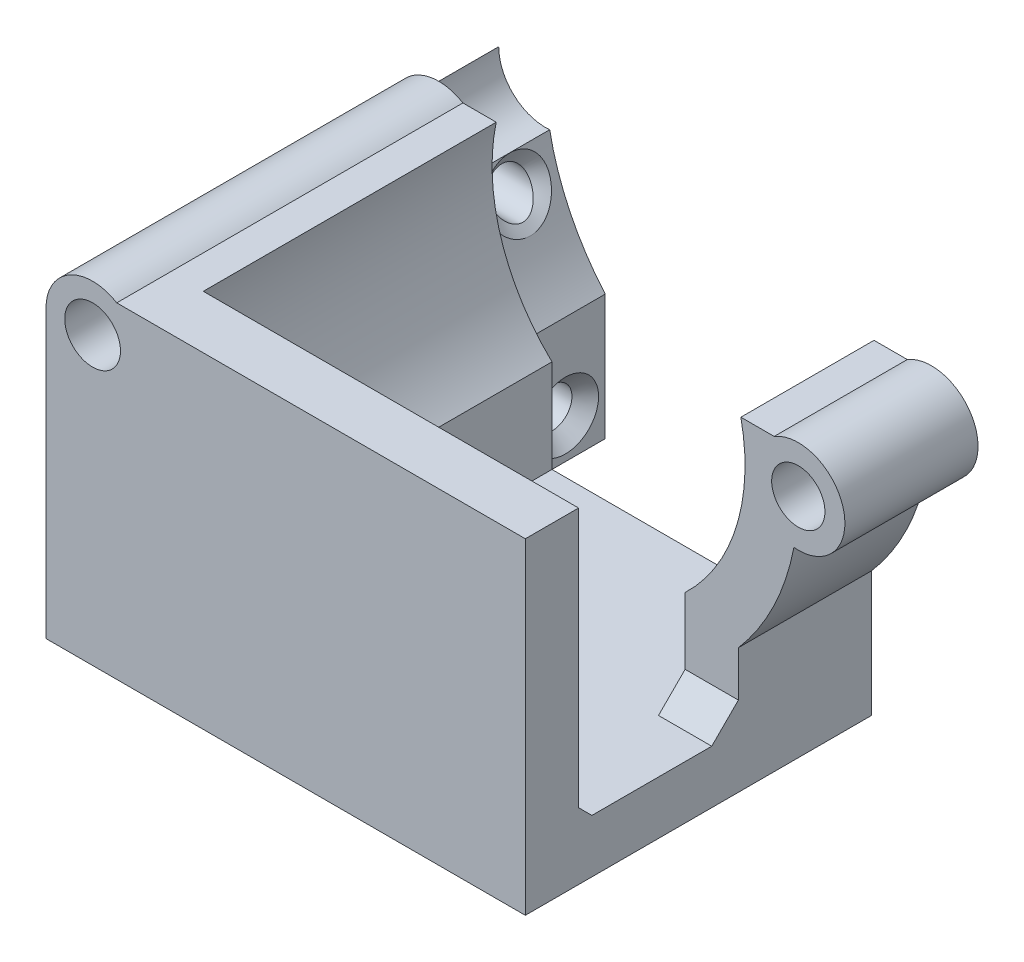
ISO-10303-21;
HEADER;
FILE_DESCRIPTION(('STEP AP214'),'2;1');
FILE_NAME('part.step','',(''),(''),'','','');
FILE_SCHEMA(('AUTOMOTIVE_DESIGN { 1 0 10303 214 1 1 1 1 }'));
ENDSEC;
DATA;
#1=APPLICATION_CONTEXT('core data for automotive mechanical design processes');
#2=APPLICATION_PROTOCOL_DEFINITION('international standard','automotive_design',2000,#1);
#3=PRODUCT_CONTEXT('',#1,'mechanical');
#4=PRODUCT('Part','Part','',(#3));
#5=PRODUCT_RELATED_PRODUCT_CATEGORY('part','',(#4));
#6=PRODUCT_DEFINITION_FORMATION('','',#4);
#7=PRODUCT_DEFINITION_CONTEXT('part definition',#1,'design');
#8=PRODUCT_DEFINITION('design','',#6,#7);
#9=PRODUCT_DEFINITION_SHAPE('','',#8);
#10=(LENGTH_UNIT() NAMED_UNIT(*) SI_UNIT(.MILLI.,.METRE.));
#11=(NAMED_UNIT(*) PLANE_ANGLE_UNIT() SI_UNIT($,.RADIAN.));
#12=(NAMED_UNIT(*) SI_UNIT($,.STERADIAN.) SOLID_ANGLE_UNIT());
#13=UNCERTAINTY_MEASURE_WITH_UNIT(LENGTH_MEASURE(1.E-05),#10,'distance_accuracy_value','');
#14=(GEOMETRIC_REPRESENTATION_CONTEXT(3) GLOBAL_UNCERTAINTY_ASSIGNED_CONTEXT((#13)) GLOBAL_UNIT_ASSIGNED_CONTEXT((#10,
#11,#12)) REPRESENTATION_CONTEXT('',''));
#15=CARTESIAN_POINT('',(0.,0.,0.));
#16=DIRECTION('',(0.,0.,1.));
#17=DIRECTION('',(1.,0.,0.));
#18=AXIS2_PLACEMENT_3D('',#15,#16,#17);
#19=CARTESIAN_POINT('',(-10.,0.,10.));
#20=DIRECTION('',(-1.,0.,0.));
#21=DIRECTION('',(0.,0.,1.));
#22=AXIS2_PLACEMENT_3D('',#19,#20,#21);
#23=PLANE('',#22);
#24=DIRECTION('',(0.,1.,0.));
#25=VECTOR('',#24,1.);
#26=CARTESIAN_POINT('',(-10.,0.,22.));
#27=LINE('',#26,#25);
#28=CARTESIAN_POINT('',(-10.,1.,22.));
#29=VERTEX_POINT('',#28);
#30=CARTESIAN_POINT('',(-10.,3.,22.));
#31=VERTEX_POINT('',#30);
#32=EDGE_CURVE('E286',#29,#31,#27,.T.);
#33=ORIENTED_EDGE('',*,*,#32,.F.);
#34=DIRECTION('',(0.,0.70710678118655,0.707106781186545));
#35=VECTOR('',#34,1.);
#36=CARTESIAN_POINT('',(-10.,1.,22.));
#37=LINE('',#36,#35);
#38=CARTESIAN_POINT('',(-10.,0.,21.));
#39=VERTEX_POINT('',#38);
#40=EDGE_CURVE('E63',#29,#39,#37,.F.);
#41=ORIENTED_EDGE('',*,*,#40,.T.);
#42=DIRECTION('',(0.,0.,-1.));
#43=VECTOR('',#42,1.);
#44=CARTESIAN_POINT('',(-10.,0.,10.));
#45=LINE('',#44,#43);
#46=CARTESIAN_POINT('',(-10.,0.,19.));
#47=VERTEX_POINT('',#46);
#48=EDGE_CURVE('E397',#39,#47,#45,.T.);
#49=ORIENTED_EDGE('',*,*,#48,.T.);
#50=CARTESIAN_POINT('',(-10.,3.,19.));
#51=DIRECTION('',(-1.,0.,0.));
#52=DIRECTION('',(0.,0.,1.));
#53=AXIS2_PLACEMENT_3D('',#50,#51,#52);
#54=CIRCLE('',#53,3.00000000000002);
#55=EDGE_CURVE('E335',#47,#31,#54,.T.);
#56=ORIENTED_EDGE('',*,*,#55,.T.);
#57=EDGE_LOOP('',(#33,#41,#49,#56));
#58=FACE_BOUND('',#57,.T.);
#59=ADVANCED_FACE('F35',(#58),#23,.F.);
#60=CARTESIAN_POINT('',(-18.5,17.5,10.));
#61=DIRECTION('',(0.,0.,-1.));
#62=DIRECTION('',(-1.,0.,0.));
#63=AXIS2_PLACEMENT_3D('',#60,#61,#62);
#64=CYLINDRICAL_SURFACE('',#63,3.49999999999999);
#65=DIRECTION('',(0.,0.,1.));
#66=VECTOR('',#65,1.);
#67=CARTESIAN_POINT('',(-22.,17.5,-2.50000000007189E-05));
#68=LINE('',#67,#66);
#69=CARTESIAN_POINT('',(-22.,17.5,-1.25000000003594E-05));
#70=VERTEX_POINT('',#69);
#71=CARTESIAN_POINT('',(-22.,17.5,26.));
#72=VERTEX_POINT('',#71);
#73=EDGE_CURVE('E226',#70,#72,#68,.T.);
#74=ORIENTED_EDGE('',*,*,#73,.T.);
#75=CARTESIAN_POINT('',(-18.5,17.5,26.));
#76=DIRECTION('',(0.,0.,1.));
#77=DIRECTION('',(1.,0.,0.));
#78=AXIS2_PLACEMENT_3D('',#75,#76,#77);
#79=CIRCLE('',#78,3.49999999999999);
#80=CARTESIAN_POINT('',(-16.6875,20.4941348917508,26.));
#81=VERTEX_POINT('',#80);
#82=EDGE_CURVE('E249',#81,#72,#79,.T.);
#83=ORIENTED_EDGE('',*,*,#82,.F.);
#84=DIRECTION('',(0.,0.,-1.));
#85=VECTOR('',#84,1.);
#86=CARTESIAN_POINT('',(-16.6875,20.4941348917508,10.));
#87=LINE('',#86,#85);
#88=CARTESIAN_POINT('',(-16.6875,20.4941348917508,0.));
#89=VERTEX_POINT('',#88);
#90=EDGE_CURVE('E390',#81,#89,#87,.T.);
#91=ORIENTED_EDGE('',*,*,#90,.T.);
#92=CARTESIAN_POINT('',(-18.5,17.5,0.));
#93=DIRECTION('',(0.,0.,1.));
#94=DIRECTION('',(-1.,0.,0.));
#95=AXIS2_PLACEMENT_3D('',#92,#93,#94);
#96=CIRCLE('',#95,3.49999999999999);
#97=EDGE_CURVE('E347',#89,#70,#96,.T.);
#98=ORIENTED_EDGE('',*,*,#97,.T.);
#99=EDGE_LOOP('',(#74,#83,#91,#98));
#100=FACE_BOUND('',#99,.T.);
#101=ADVANCED_FACE('F430',(#100),#64,.T.);
#102=CARTESIAN_POINT('',(0.,17.5,10.));
#103=DIRECTION('',(0.,0.,1.));
#104=DIRECTION('',(1.,0.,0.));
#105=AXIS2_PLACEMENT_3D('',#102,#103,#104);
#106=PLANE('',#105);
#107=CARTESIAN_POINT('',(-18.5,17.5,10.));
#108=DIRECTION('',(0.,0.,1.));
#109=DIRECTION('',(-1.,0.,0.));
#110=AXIS2_PLACEMENT_3D('',#107,#108,#109);
#111=CIRCLE('',#110,2.00000000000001);
#112=CARTESIAN_POINT('',(-20.5,17.5,10.));
#113=VERTEX_POINT('',#112);
#114=EDGE_CURVE('E293',#113,#113,#111,.T.);
#115=ORIENTED_EDGE('',*,*,#114,.F.);
#116=EDGE_LOOP('',(#115));
#117=FACE_BOUND('',#116,.T.);
#118=CARTESIAN_POINT('',(-18.5,17.5,10.));
#119=DIRECTION('',(0.,0.,1.));
#120=DIRECTION('',(1.,0.,0.));
#121=AXIS2_PLACEMENT_3D('',#118,#119,#120);
#122=CIRCLE('',#121,2.09288168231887);
#123=CARTESIAN_POINT('',(-16.4071183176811,17.5,10.));
#124=VERTEX_POINT('',#123);
#125=EDGE_CURVE('E448',#124,#124,#122,.T.);
#126=ORIENTED_EDGE('',*,*,#125,.T.);
#127=EDGE_LOOP('',(#126));
#128=FACE_BOUND('',#127,.T.);
#129=ADVANCED_FACE('F492',(#117,#128),#106,.T.);
#130=DIRECTION('',(0.,-1.,0.));
#131=VECTOR('',#130,1.);
#132=CARTESIAN_POINT('',(10.,0.,10.));
#133=LINE('',#132,#131);
#134=CARTESIAN_POINT('',(10.,7.,10.));
#135=VERTEX_POINT('',#134);
#136=CARTESIAN_POINT('',(10.,1.99999999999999,10.));
#137=VERTEX_POINT('',#136);
#138=EDGE_CURVE('E313',#135,#137,#133,.T.);
#139=ORIENTED_EDGE('',*,*,#138,.T.);
#140=DIRECTION('',(1.,0.,0.));
#141=VECTOR('',#140,1.);
#142=CARTESIAN_POINT('',(0.,1.99999999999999,10.));
#143=LINE('',#142,#141);
#144=CARTESIAN_POINT('',(14.,1.99999999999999,10.));
#145=VERTEX_POINT('',#144);
#146=EDGE_CURVE('E316',#137,#145,#143,.T.);
#147=ORIENTED_EDGE('',*,*,#146,.T.);
#148=DIRECTION('',(0.,1.,0.));
#149=VECTOR('',#148,1.);
#150=CARTESIAN_POINT('',(14.,-4.,10.));
#151=LINE('',#150,#149);
#152=CARTESIAN_POINT('',(14.,5.40661337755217,10.));
#153=VERTEX_POINT('',#152);
#154=EDGE_CURVE('E310',#145,#153,#151,.T.);
#155=ORIENTED_EDGE('',*,*,#154,.T.);
#156=CARTESIAN_POINT('',(0.,17.5,10.));
#157=DIRECTION('',(0.,0.,1.));
#158=DIRECTION('',(1.,0.,0.));
#159=AXIS2_PLACEMENT_3D('',#156,#157,#158);
#160=CIRCLE('',#159,18.5);
#161=CARTESIAN_POINT('',(18.1689189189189,14.0156944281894,10.));
#162=VERTEX_POINT('',#161);
#163=EDGE_CURVE('E307',#153,#162,#160,.T.);
#164=ORIENTED_EDGE('',*,*,#163,.T.);
#165=CARTESIAN_POINT('',(18.5,17.5,10.));
#166=DIRECTION('',(0.,0.,1.));
#167=DIRECTION('',(1.,0.,0.));
#168=AXIS2_PLACEMENT_3D('',#165,#166,#167);
#169=CIRCLE('',#168,3.49999999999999);
#170=CARTESIAN_POINT('',(16.6875,20.4941348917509,10.));
#171=VERTEX_POINT('',#170);
#172=EDGE_CURVE('E907',#162,#171,#169,.T.);
#173=ORIENTED_EDGE('',*,*,#172,.T.);
#174=DIRECTION('',(-1.,0.,0.));
#175=VECTOR('',#174,1.);
#176=CARTESIAN_POINT('',(14.1875,20.4941348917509,10.));
#177=LINE('',#176,#175);
#178=CARTESIAN_POINT('',(14.1875,20.4941348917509,10.));
#179=VERTEX_POINT('',#178);
#180=EDGE_CURVE('E909',#171,#179,#177,.T.);
#181=ORIENTED_EDGE('',*,*,#180,.T.);
#182=CARTESIAN_POINT('',(0.,17.5,10.));
#183=DIRECTION('',(0.,0.,-1.));
#184=DIRECTION('',(1.,0.,0.));
#185=AXIS2_PLACEMENT_3D('',#182,#183,#184);
#186=CIRCLE('',#185,14.5);
#187=EDGE_CURVE('E375',#179,#135,#186,.T.);
#188=ORIENTED_EDGE('',*,*,#187,.T.);
#189=EDGE_LOOP('',(#139,#147,#155,#164,#173,#181,#188));
#190=FACE_BOUND('',#189,.T.);
#191=CARTESIAN_POINT('',(18.5,17.5,10.));
#192=DIRECTION('',(0.,0.,1.));
#193=DIRECTION('',(1.,0.,0.));
#194=AXIS2_PLACEMENT_3D('',#191,#192,#193);
#195=CIRCLE('',#194,2.00000000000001);
#196=CARTESIAN_POINT('',(20.5,17.5,10.));
#197=VERTEX_POINT('',#196);
#198=EDGE_CURVE('E299',#197,#197,#195,.T.);
#199=ORIENTED_EDGE('',*,*,#198,.F.);
#200=EDGE_LOOP('',(#199));
#201=FACE_BOUND('',#200,.T.);
#202=ADVANCED_FACE('F597',(#190,#201),#106,.T.);
#203=CARTESIAN_POINT('',(0.,17.5,0.));
#204=DIRECTION('',(0.,0.,1.));
#205=DIRECTION('',(1.,0.,0.));
#206=AXIS2_PLACEMENT_3D('',#203,#204,#205);
#207=PLANE('',#206);
#208=CARTESIAN_POINT('',(18.5,17.5,0.));
#209=DIRECTION('',(0.,0.,1.));
#210=DIRECTION('',(1.,0.,0.));
#211=AXIS2_PLACEMENT_3D('',#208,#209,#210);
#212=CIRCLE('',#211,2.00000000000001);
#213=CARTESIAN_POINT('',(20.5,17.5,0.));
#214=VERTEX_POINT('',#213);
#215=EDGE_CURVE('E296',#214,#214,#212,.T.);
#216=ORIENTED_EDGE('',*,*,#215,.T.);
#217=EDGE_LOOP('',(#216));
#218=FACE_BOUND('',#217,.T.);
#219=DIRECTION('',(0.,-1.,0.));
#220=VECTOR('',#219,1.);
#221=CARTESIAN_POINT('',(10.,0.,0.));
#222=LINE('',#221,#220);
#223=CARTESIAN_POINT('',(10.,7.,0.));
#224=VERTEX_POINT('',#223);
#225=CARTESIAN_POINT('',(10.,0.,0.));
#226=VERTEX_POINT('',#225);
#227=EDGE_CURVE('E302',#224,#226,#222,.T.);
#228=ORIENTED_EDGE('',*,*,#227,.F.);
#229=CARTESIAN_POINT('',(0.,17.5,0.));
#230=DIRECTION('',(0.,0.,-1.));
#231=DIRECTION('',(1.,0.,0.));
#232=AXIS2_PLACEMENT_3D('',#229,#230,#231);
#233=CIRCLE('',#232,14.5);
#234=CARTESIAN_POINT('',(14.1875,20.4941348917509,0.));
#235=VERTEX_POINT('',#234);
#236=EDGE_CURVE('E369',#235,#224,#233,.T.);
#237=ORIENTED_EDGE('',*,*,#236,.F.);
#238=DIRECTION('',(-1.,0.,0.));
#239=VECTOR('',#238,1.);
#240=CARTESIAN_POINT('',(14.1875,20.4941348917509,0.));
#241=LINE('',#240,#239);
#242=CARTESIAN_POINT('',(16.6875,20.4941348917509,0.));
#243=VERTEX_POINT('',#242);
#244=EDGE_CURVE('E367',#243,#235,#241,.T.);
#245=ORIENTED_EDGE('',*,*,#244,.F.);
#246=CARTESIAN_POINT('',(18.5,17.5,0.));
#247=DIRECTION('',(0.,0.,1.));
#248=DIRECTION('',(1.,0.,0.));
#249=AXIS2_PLACEMENT_3D('',#246,#247,#248);
#250=CIRCLE('',#249,3.49999999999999);
#251=CARTESIAN_POINT('',(18.1689189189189,14.0156944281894,0.));
#252=VERTEX_POINT('',#251);
#253=EDGE_CURVE('E365',#252,#243,#250,.T.);
#254=ORIENTED_EDGE('',*,*,#253,.F.);
#255=CARTESIAN_POINT('',(0.,17.5,0.));
#256=DIRECTION('',(0.,0.,1.));
#257=DIRECTION('',(1.,0.,0.));
#258=AXIS2_PLACEMENT_3D('',#255,#256,#257);
#259=CIRCLE('',#258,18.5);
#260=CARTESIAN_POINT('',(14.,5.40661337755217,0.));
#261=VERTEX_POINT('',#260);
#262=EDGE_CURVE('E363',#261,#252,#259,.T.);
#263=ORIENTED_EDGE('',*,*,#262,.F.);
#264=DIRECTION('',(0.,1.,0.));
#265=VECTOR('',#264,1.);
#266=CARTESIAN_POINT('',(14.,-4.,0.));
#267=LINE('',#266,#265);
#268=CARTESIAN_POINT('',(14.,-4.,0.));
#269=VERTEX_POINT('',#268);
#270=EDGE_CURVE('E360',#269,#261,#267,.T.);
#271=ORIENTED_EDGE('',*,*,#270,.F.);
#272=DIRECTION('',(1.,0.,0.));
#273=VECTOR('',#272,1.);
#274=CARTESIAN_POINT('',(0.,-4.,0.));
#275=LINE('',#274,#273);
#276=CARTESIAN_POINT('',(-14.,-4.,0.));
#277=VERTEX_POINT('',#276);
#278=EDGE_CURVE('E358',#277,#269,#275,.T.);
#279=ORIENTED_EDGE('',*,*,#278,.F.);
#280=DIRECTION('',(0.,-1.,0.));
#281=VECTOR('',#280,1.);
#282=CARTESIAN_POINT('',(-14.,-4.,0.));
#283=LINE('',#282,#281);
#284=CARTESIAN_POINT('',(-14.,5.40661337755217,-1.25000000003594E-05));
#285=VERTEX_POINT('',#284);
#286=EDGE_CURVE('E361',#285,#277,#283,.T.);
#287=ORIENTED_EDGE('',*,*,#286,.F.);
#288=CARTESIAN_POINT('',(0.,17.5,0.));
#289=DIRECTION('',(0.,0.,1.));
#290=DIRECTION('',(-1.,0.,0.));
#291=AXIS2_PLACEMENT_3D('',#288,#289,#290);
#292=CIRCLE('',#291,18.5);
#293=CARTESIAN_POINT('',(-18.1689189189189,14.0156944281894,0.));
#294=VERTEX_POINT('',#293);
#295=EDGE_CURVE('E210',#294,#285,#292,.T.);
#296=ORIENTED_EDGE('',*,*,#295,.F.);
#297=CARTESIAN_POINT('',(-18.5,17.5,0.));
#298=DIRECTION('',(0.,0.,1.));
#299=DIRECTION('',(1.,0.,0.));
#300=AXIS2_PLACEMENT_3D('',#297,#298,#299);
#301=CIRCLE('',#300,3.49999999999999);
#302=EDGE_CURVE('E229',#294,#70,#301,.F.);
#303=ORIENTED_EDGE('',*,*,#302,.T.);
#304=ORIENTED_EDGE('',*,*,#97,.F.);
#305=DIRECTION('',(-1.,0.,0.));
#306=VECTOR('',#305,1.);
#307=CARTESIAN_POINT('',(-14.1875,20.4941348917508,0.));
#308=LINE('',#307,#306);
#309=CARTESIAN_POINT('',(-14.1875,20.4941348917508,0.));
#310=VERTEX_POINT('',#309);
#311=EDGE_CURVE('E351',#310,#89,#308,.T.);
#312=ORIENTED_EDGE('',*,*,#311,.F.);
#313=CARTESIAN_POINT('',(0.,17.5,0.));
#314=DIRECTION('',(0.,0.,-1.));
#315=DIRECTION('',(-1.,0.,0.));
#316=AXIS2_PLACEMENT_3D('',#313,#314,#315);
#317=CIRCLE('',#316,14.5);
#318=CARTESIAN_POINT('',(-10.,7.,0.));
#319=VERTEX_POINT('',#318);
#320=EDGE_CURVE('E418',#319,#310,#317,.T.);
#321=ORIENTED_EDGE('',*,*,#320,.F.);
#322=DIRECTION('',(0.,1.,0.));
#323=VECTOR('',#322,1.);
#324=CARTESIAN_POINT('',(-10.,0.,0.));
#325=LINE('',#324,#323);
#326=CARTESIAN_POINT('',(-10.,0.,0.));
#327=VERTEX_POINT('',#326);
#328=EDGE_CURVE('E413',#327,#319,#325,.T.);
#329=ORIENTED_EDGE('',*,*,#328,.F.);
#330=DIRECTION('',(-1.,0.,0.));
#331=VECTOR('',#330,1.);
#332=CARTESIAN_POINT('',(0.,0.,0.));
#333=LINE('',#332,#331);
#334=EDGE_CURVE('E405',#226,#327,#333,.T.);
#335=ORIENTED_EDGE('',*,*,#334,.F.);
#336=EDGE_LOOP('',(#228,#237,#245,#254,#263,#271,#279,#287,#296,#303,#304,#312,#321,#329,#335));
#337=FACE_BOUND('',#336,.T.);
#338=CARTESIAN_POINT('',(-18.5,17.5,0.));
#339=DIRECTION('',(0.,0.,1.));
#340=DIRECTION('',(-1.,0.,0.));
#341=AXIS2_PLACEMENT_3D('',#338,#339,#340);
#342=CIRCLE('',#341,2.00000000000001);
#343=CARTESIAN_POINT('',(-20.5,17.5,0.));
#344=VERTEX_POINT('',#343);
#345=EDGE_CURVE('E275',#344,#344,#342,.T.);
#346=ORIENTED_EDGE('',*,*,#345,.T.);
#347=EDGE_LOOP('',(#346));
#348=FACE_BOUND('',#347,.T.);
#349=ADVANCED_FACE('F431',(#218,#337,#348),#207,.F.);
#350=CARTESIAN_POINT('',(10.,0.,10.));
#351=DIRECTION('',(1.,0.,0.));
#352=DIRECTION('',(0.,0.,-1.));
#353=AXIS2_PLACEMENT_3D('',#350,#351,#352);
#354=PLANE('',#353);
#355=ORIENTED_EDGE('',*,*,#227,.T.);
#356=DIRECTION('',(0.,0.,-1.));
#357=VECTOR('',#356,1.);
#358=CARTESIAN_POINT('',(10.,0.,10.));
#359=LINE('',#358,#357);
#360=CARTESIAN_POINT('',(10.,0.,12.));
#361=VERTEX_POINT('',#360);
#362=EDGE_CURVE('E345',#361,#226,#359,.T.);
#363=ORIENTED_EDGE('',*,*,#362,.F.);
#364=DIRECTION('',(0.,0.707106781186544,-0.707106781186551));
#365=VECTOR('',#364,1.);
#366=CARTESIAN_POINT('',(10.,1.00000000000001,11.));
#367=LINE('',#366,#365);
#368=EDGE_CURVE('E317',#361,#137,#367,.T.);
#369=ORIENTED_EDGE('',*,*,#368,.T.);
#370=ORIENTED_EDGE('',*,*,#138,.F.);
#371=DIRECTION('',(0.,0.,-1.));
#372=VECTOR('',#371,1.);
#373=CARTESIAN_POINT('',(10.,7.,10.));
#374=LINE('',#373,#372);
#375=EDGE_CURVE('E371',#135,#224,#374,.T.);
#376=ORIENTED_EDGE('',*,*,#375,.T.);
#377=EDGE_LOOP('',(#355,#363,#369,#370,#376));
#378=FACE_BOUND('',#377,.T.);
#379=ADVANCED_FACE('F408',(#378),#354,.F.);
#380=CARTESIAN_POINT('',(0.,0.,10.));
#381=DIRECTION('',(0.,-1.,0.));
#382=DIRECTION('',(0.,0.,-1.));
#383=AXIS2_PLACEMENT_3D('',#380,#381,#382);
#384=PLANE('',#383);
#385=ORIENTED_EDGE('',*,*,#48,.F.);
#386=DIRECTION('',(1.,0.,0.));
#387=VECTOR('',#386,1.);
#388=CARTESIAN_POINT('',(14.,0.,21.));
#389=LINE('',#388,#387);
#390=CARTESIAN_POINT('',(14.,0.,21.));
#391=VERTEX_POINT('',#390);
#392=EDGE_CURVE('E55',#39,#391,#389,.T.);
#393=ORIENTED_EDGE('',*,*,#392,.T.);
#394=DIRECTION('',(0.,0.,-1.));
#395=VECTOR('',#394,1.);
#396=CARTESIAN_POINT('',(14.,0.,22.));
#397=LINE('',#396,#395);
#398=CARTESIAN_POINT('',(14.,0.,12.));
#399=VERTEX_POINT('',#398);
#400=EDGE_CURVE('E272',#391,#399,#397,.T.);
#401=ORIENTED_EDGE('',*,*,#400,.T.);
#402=DIRECTION('',(-1.,0.,0.));
#403=VECTOR('',#402,1.);
#404=CARTESIAN_POINT('',(0.,0.,12.));
#405=LINE('',#404,#403);
#406=EDGE_CURVE('E314',#399,#361,#405,.T.);
#407=ORIENTED_EDGE('',*,*,#406,.T.);
#408=ORIENTED_EDGE('',*,*,#362,.T.);
#409=ORIENTED_EDGE('',*,*,#334,.T.);
#410=EDGE_CURVE('E396',#47,#327,#45,.T.);
#411=ORIENTED_EDGE('',*,*,#410,.F.);
#412=EDGE_LOOP('',(#385,#393,#401,#407,#408,#409,#411));
#413=FACE_BOUND('',#412,.T.);
#414=ADVANCED_FACE('F403',(#413),#384,.F.);
#415=CARTESIAN_POINT('',(-10.,7.,22.));
#416=VERTEX_POINT('',#415);
#417=EDGE_CURVE('E450',#31,#416,#27,.T.);
#418=ORIENTED_EDGE('',*,*,#417,.F.);
#419=CARTESIAN_POINT('',(-10.,3.,19.));
#420=DIRECTION('',(-1.,0.,0.));
#421=DIRECTION('',(0.,0.,1.));
#422=AXIS2_PLACEMENT_3D('',#419,#420,#421);
#423=CIRCLE('',#422,3.00000000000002);
#424=EDGE_CURVE('E337',#31,#47,#423,.T.);
#425=ORIENTED_EDGE('',*,*,#424,.T.);
#426=ORIENTED_EDGE('',*,*,#410,.T.);
#427=ORIENTED_EDGE('',*,*,#328,.T.);
#428=DIRECTION('',(0.,0.,-1.));
#429=VECTOR('',#428,1.);
#430=CARTESIAN_POINT('',(-10.,7.,10.));
#431=LINE('',#430,#429);
#432=EDGE_CURVE('E393',#416,#319,#431,.T.);
#433=ORIENTED_EDGE('',*,*,#432,.F.);
#434=EDGE_LOOP('',(#418,#425,#426,#427,#433));
#435=FACE_BOUND('',#434,.T.);
#436=ADVANCED_FACE('F459',(#435),#23,.F.);
#437=CARTESIAN_POINT('',(0.,17.5,10.));
#438=DIRECTION('',(0.,0.,-1.));
#439=DIRECTION('',(-1.,0.,0.));
#440=AXIS2_PLACEMENT_3D('',#437,#438,#439);
#441=CYLINDRICAL_SURFACE('',#440,14.5);
#442=ORIENTED_EDGE('',*,*,#320,.T.);
#443=DIRECTION('',(0.,0.,-1.));
#444=VECTOR('',#443,1.);
#445=CARTESIAN_POINT('',(-14.1875,20.4941348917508,10.));
#446=LINE('',#445,#444);
#447=CARTESIAN_POINT('',(-14.1875,20.4941348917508,22.));
#448=VERTEX_POINT('',#447);
#449=EDGE_CURVE('E287',#448,#310,#446,.T.);
#450=ORIENTED_EDGE('',*,*,#449,.F.);
#451=CARTESIAN_POINT('',(0.,17.5,22.));
#452=DIRECTION('',(0.,0.,-1.));
#453=DIRECTION('',(1.,0.,0.));
#454=AXIS2_PLACEMENT_3D('',#451,#452,#453);
#455=CIRCLE('',#454,14.5);
#456=EDGE_CURVE('E276',#416,#448,#455,.T.);
#457=ORIENTED_EDGE('',*,*,#456,.F.);
#458=ORIENTED_EDGE('',*,*,#432,.T.);
#459=EDGE_LOOP('',(#442,#450,#457,#458));
#460=FACE_BOUND('',#459,.T.);
#461=ADVANCED_FACE('F457',(#460),#441,.F.);
#462=CARTESIAN_POINT('',(-14.1875,20.4941348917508,10.));
#463=DIRECTION('',(0.,-1.,0.));
#464=DIRECTION('',(0.,0.,-1.));
#465=AXIS2_PLACEMENT_3D('',#462,#463,#464);
#466=PLANE('',#465);
#467=ORIENTED_EDGE('',*,*,#311,.T.);
#468=ORIENTED_EDGE('',*,*,#90,.F.);
#469=DIRECTION('',(-1.,0.,0.));
#470=VECTOR('',#469,1.);
#471=CARTESIAN_POINT('',(-14.1875,20.4941348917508,26.));
#472=LINE('',#471,#470);
#473=CARTESIAN_POINT('',(14.,20.4941348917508,26.));
#474=VERTEX_POINT('',#473);
#475=EDGE_CURVE('E246',#474,#81,#472,.T.);
#476=ORIENTED_EDGE('',*,*,#475,.F.);
#477=DIRECTION('',(0.,0.,-1.));
#478=VECTOR('',#477,1.);
#479=CARTESIAN_POINT('',(14.,20.4941348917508,26.));
#480=LINE('',#479,#478);
#481=CARTESIAN_POINT('',(14.,20.4941348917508,22.));
#482=VERTEX_POINT('',#481);
#483=EDGE_CURVE('E258',#474,#482,#480,.T.);
#484=ORIENTED_EDGE('',*,*,#483,.T.);
#485=DIRECTION('',(-1.,0.,0.));
#486=VECTOR('',#485,1.);
#487=CARTESIAN_POINT('',(-14.1875,20.4941348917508,22.));
#488=LINE('',#487,#486);
#489=EDGE_CURVE('E250',#482,#448,#488,.T.);
#490=ORIENTED_EDGE('',*,*,#489,.T.);
#491=ORIENTED_EDGE('',*,*,#449,.T.);
#492=EDGE_LOOP('',(#467,#468,#476,#484,#490,#491));
#493=FACE_BOUND('',#492,.T.);
#494=ADVANCED_FACE('F424',(#493),#466,.F.);
#495=CARTESIAN_POINT('',(0.,-4.,10.));
#496=DIRECTION('',(0.,1.,0.));
#497=DIRECTION('',(-1.,0.,0.));
#498=AXIS2_PLACEMENT_3D('',#495,#496,#497);
#499=PLANE('',#498);
#500=ORIENTED_EDGE('',*,*,#278,.T.);
#501=DIRECTION('',(0.,0.,-1.));
#502=VECTOR('',#501,1.);
#503=CARTESIAN_POINT('',(14.,-4.,10.));
#504=LINE('',#503,#502);
#505=CARTESIAN_POINT('',(14.,-4.,26.));
#506=VERTEX_POINT('',#505);
#507=EDGE_CURVE('E387',#506,#269,#504,.T.);
#508=ORIENTED_EDGE('',*,*,#507,.F.);
#509=DIRECTION('',(1.,0.,0.));
#510=VECTOR('',#509,1.);
#511=CARTESIAN_POINT('',(-14.,-4.,26.));
#512=LINE('',#511,#510);
#513=CARTESIAN_POINT('',(-22.,-4.,26.));
#514=VERTEX_POINT('',#513);
#515=EDGE_CURVE('E253',#514,#506,#512,.T.);
#516=ORIENTED_EDGE('',*,*,#515,.F.);
#517=DIRECTION('',(0.,0.,1.));
#518=VECTOR('',#517,1.);
#519=CARTESIAN_POINT('',(-22.,-4.,-2.50000000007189E-05));
#520=LINE('',#519,#518);
#521=CARTESIAN_POINT('',(-22.,-4.,-8.000025));
#522=VERTEX_POINT('',#521);
#523=EDGE_CURVE('E231',#522,#514,#520,.T.);
#524=ORIENTED_EDGE('',*,*,#523,.F.);
#525=DIRECTION('',(-1.,0.,0.));
#526=VECTOR('',#525,1.);
#527=CARTESIAN_POINT('',(-14.,-4.,-8.000025));
#528=LINE('',#527,#526);
#529=CARTESIAN_POINT('',(-14.,-4.,-8.000025));
#530=VERTEX_POINT('',#529);
#531=EDGE_CURVE('E196',#530,#522,#528,.T.);
#532=ORIENTED_EDGE('',*,*,#531,.F.);
#533=DIRECTION('',(0.,0.,1.));
#534=VECTOR('',#533,1.);
#535=CARTESIAN_POINT('',(-14.,-4.,-2.50000000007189E-05));
#536=LINE('',#535,#534);
#537=EDGE_CURVE('E192',#530,#277,#536,.T.);
#538=ORIENTED_EDGE('',*,*,#537,.T.);
#539=EDGE_LOOP('',(#500,#508,#516,#524,#532,#538));
#540=FACE_BOUND('',#539,.T.);
#541=ADVANCED_FACE('F621',(#540),#499,.F.);
#542=CARTESIAN_POINT('',(14.,-4.,10.));
#543=DIRECTION('',(-1.,0.,0.));
#544=DIRECTION('',(0.,0.,1.));
#545=AXIS2_PLACEMENT_3D('',#542,#543,#544);
#546=PLANE('',#545);
#547=ORIENTED_EDGE('',*,*,#270,.T.);
#548=DIRECTION('',(0.,0.,-1.));
#549=VECTOR('',#548,1.);
#550=CARTESIAN_POINT('',(14.,5.40661337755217,10.));
#551=LINE('',#550,#549);
#552=EDGE_CURVE('E384',#153,#261,#551,.T.);
#553=ORIENTED_EDGE('',*,*,#552,.F.);
#554=ORIENTED_EDGE('',*,*,#154,.F.);
#555=DIRECTION('',(0.,-0.707106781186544,0.707106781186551));
#556=VECTOR('',#555,1.);
#557=CARTESIAN_POINT('',(14.,-0.999999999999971,13.));
#558=LINE('',#557,#556);
#559=EDGE_CURVE('E266',#145,#399,#558,.T.);
#560=ORIENTED_EDGE('',*,*,#559,.T.);
#561=ORIENTED_EDGE('',*,*,#400,.F.);
#562=DIRECTION('',(0.,-0.70710678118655,-0.707106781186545));
#563=VECTOR('',#562,1.);
#564=CARTESIAN_POINT('',(14.,-7.50000000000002,13.5));
#565=LINE('',#564,#563);
#566=CARTESIAN_POINT('',(14.,1.00000000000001,22.));
#567=VERTEX_POINT('',#566);
#568=EDGE_CURVE('E530',#391,#567,#565,.F.);
#569=ORIENTED_EDGE('',*,*,#568,.T.);
#570=DIRECTION('',(0.,1.,0.));
#571=VECTOR('',#570,1.);
#572=CARTESIAN_POINT('',(14.,20.4941348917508,22.));
#573=LINE('',#572,#571);
#574=EDGE_CURVE('E245',#567,#482,#573,.T.);
#575=ORIENTED_EDGE('',*,*,#574,.T.);
#576=ORIENTED_EDGE('',*,*,#483,.F.);
#577=DIRECTION('',(0.,1.,0.));
#578=VECTOR('',#577,1.);
#579=CARTESIAN_POINT('',(14.,-4.,26.));
#580=LINE('',#579,#578);
#581=EDGE_CURVE('E256',#506,#474,#580,.T.);
#582=ORIENTED_EDGE('',*,*,#581,.F.);
#583=ORIENTED_EDGE('',*,*,#507,.T.);
#584=EDGE_LOOP('',(#547,#553,#554,#560,#561,#569,#575,#576,#582,#583));
#585=FACE_BOUND('',#584,.T.);
#586=ADVANCED_FACE('F327',(#585),#546,.F.);
#587=CARTESIAN_POINT('',(0.,17.5,10.));
#588=DIRECTION('',(0.,0.,-1.));
#589=DIRECTION('',(-1.,0.,0.));
#590=AXIS2_PLACEMENT_3D('',#587,#588,#589);
#591=CYLINDRICAL_SURFACE('',#590,18.5);
#592=ORIENTED_EDGE('',*,*,#262,.T.);
#593=DIRECTION('',(0.,0.,-1.));
#594=VECTOR('',#593,1.);
#595=CARTESIAN_POINT('',(18.1689189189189,14.0156944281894,10.));
#596=LINE('',#595,#594);
#597=EDGE_CURVE('E381',#162,#252,#596,.T.);
#598=ORIENTED_EDGE('',*,*,#597,.F.);
#599=ORIENTED_EDGE('',*,*,#163,.F.);
#600=ORIENTED_EDGE('',*,*,#552,.T.);
#601=EDGE_LOOP('',(#592,#598,#599,#600));
#602=FACE_BOUND('',#601,.T.);
#603=ADVANCED_FACE('F614',(#602),#591,.T.);
#604=CARTESIAN_POINT('',(18.5,17.5,10.));
#605=DIRECTION('',(0.,0.,-1.));
#606=DIRECTION('',(-1.,0.,0.));
#607=AXIS2_PLACEMENT_3D('',#604,#605,#606);
#608=CYLINDRICAL_SURFACE('',#607,3.49999999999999);
#609=ORIENTED_EDGE('',*,*,#253,.T.);
#610=DIRECTION('',(0.,0.,-1.));
#611=VECTOR('',#610,1.);
#612=CARTESIAN_POINT('',(16.6875,20.4941348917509,10.));
#613=LINE('',#612,#611);
#614=EDGE_CURVE('E378',#171,#243,#613,.T.);
#615=ORIENTED_EDGE('',*,*,#614,.F.);
#616=ORIENTED_EDGE('',*,*,#172,.F.);
#617=ORIENTED_EDGE('',*,*,#597,.T.);
#618=EDGE_LOOP('',(#609,#615,#616,#617));
#619=FACE_BOUND('',#618,.T.);
#620=ADVANCED_FACE('F610',(#619),#608,.T.);
#621=CARTESIAN_POINT('',(14.1875,20.4941348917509,10.));
#622=DIRECTION('',(0.,-1.,0.));
#623=DIRECTION('',(0.,0.,-1.));
#624=AXIS2_PLACEMENT_3D('',#621,#622,#623);
#625=PLANE('',#624);
#626=ORIENTED_EDGE('',*,*,#244,.T.);
#627=DIRECTION('',(0.,0.,-1.));
#628=VECTOR('',#627,1.);
#629=CARTESIAN_POINT('',(14.1875,20.4941348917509,10.));
#630=LINE('',#629,#628);
#631=EDGE_CURVE('E374',#179,#235,#630,.T.);
#632=ORIENTED_EDGE('',*,*,#631,.F.);
#633=ORIENTED_EDGE('',*,*,#180,.F.);
#634=ORIENTED_EDGE('',*,*,#614,.T.);
#635=EDGE_LOOP('',(#626,#632,#633,#634));
#636=FACE_BOUND('',#635,.T.);
#637=ADVANCED_FACE('F606',(#636),#625,.F.);
#638=CARTESIAN_POINT('',(0.,17.5,10.));
#639=DIRECTION('',(0.,0.,-1.));
#640=DIRECTION('',(-1.,0.,0.));
#641=AXIS2_PLACEMENT_3D('',#638,#639,#640);
#642=CYLINDRICAL_SURFACE('',#641,14.5);
#643=ORIENTED_EDGE('',*,*,#236,.T.);
#644=ORIENTED_EDGE('',*,*,#375,.F.);
#645=ORIENTED_EDGE('',*,*,#187,.F.);
#646=ORIENTED_EDGE('',*,*,#631,.T.);
#647=EDGE_LOOP('',(#643,#644,#645,#646));
#648=FACE_BOUND('',#647,.T.);
#649=ADVANCED_FACE('F595',(#648),#642,.F.);
#650=CARTESIAN_POINT('',(18.5,17.5,10.));
#651=DIRECTION('',(0.,0.,-1.));
#652=DIRECTION('',(-1.,0.,0.));
#653=AXIS2_PLACEMENT_3D('',#650,#651,#652);
#654=CYLINDRICAL_SURFACE('',#653,2.00000000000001);
#655=ORIENTED_EDGE('',*,*,#198,.T.);
#656=EDGE_LOOP('',(#655));
#657=FACE_BOUND('',#656,.T.);
#658=ORIENTED_EDGE('',*,*,#215,.F.);
#659=EDGE_LOOP('',(#658));
#660=FACE_BOUND('',#659,.T.);
#661=ADVANCED_FACE('F591',(#657,#660),#654,.F.);
#662=CARTESIAN_POINT('',(-18.5,17.5,10.));
#663=DIRECTION('',(0.,0.,-1.));
#664=DIRECTION('',(-1.,0.,0.));
#665=AXIS2_PLACEMENT_3D('',#662,#663,#664);
#666=CYLINDRICAL_SURFACE('',#665,2.00000000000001);
#667=ORIENTED_EDGE('',*,*,#114,.T.);
#668=EDGE_LOOP('',(#667));
#669=FACE_BOUND('',#668,.T.);
#670=ORIENTED_EDGE('',*,*,#345,.F.);
#671=EDGE_LOOP('',(#670));
#672=FACE_BOUND('',#671,.T.);
#673=ADVANCED_FACE('F587',(#669,#672),#666,.F.);
#674=CARTESIAN_POINT('',(-18.5,17.5,22.));
#675=DIRECTION('',(0.,0.,-1.));
#676=DIRECTION('',(-1.,0.,0.));
#677=AXIS2_PLACEMENT_3D('',#674,#675,#676);
#678=CYLINDRICAL_SURFACE('',#677,2.09288168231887);
#679=ORIENTED_EDGE('',*,*,#125,.F.);
#680=EDGE_LOOP('',(#679));
#681=FACE_BOUND('',#680,.T.);
#682=CARTESIAN_POINT('',(-18.5,17.5,26.));
#683=DIRECTION('',(0.,0.,1.));
#684=DIRECTION('',(1.,0.,0.));
#685=AXIS2_PLACEMENT_3D('',#682,#683,#684);
#686=CIRCLE('',#685,2.09288168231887);
#687=CARTESIAN_POINT('',(-16.4071183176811,17.5,26.));
#688=VERTEX_POINT('',#687);
#689=EDGE_CURVE('E240',#688,#688,#686,.T.);
#690=ORIENTED_EDGE('',*,*,#689,.T.);
#691=EDGE_LOOP('',(#690));
#692=FACE_BOUND('',#691,.T.);
#693=ADVANCED_FACE('F584',(#681,#692),#678,.F.);
#694=CARTESIAN_POINT('',(-18.5,17.5,22.));
#695=DIRECTION('',(0.,0.,1.));
#696=DIRECTION('',(1.,0.,0.));
#697=AXIS2_PLACEMENT_3D('',#694,#695,#696);
#698=PLANE('',#697);
#699=ORIENTED_EDGE('',*,*,#574,.F.);
#700=DIRECTION('',(-1.,0.,0.));
#701=VECTOR('',#700,1.);
#702=CARTESIAN_POINT('',(-10.,1.,22.));
#703=LINE('',#702,#701);
#704=EDGE_CURVE('E268',#567,#29,#703,.T.);
#705=ORIENTED_EDGE('',*,*,#704,.T.);
#706=ORIENTED_EDGE('',*,*,#32,.T.);
#707=ORIENTED_EDGE('',*,*,#417,.T.);
#708=ORIENTED_EDGE('',*,*,#456,.T.);
#709=ORIENTED_EDGE('',*,*,#489,.F.);
#710=EDGE_LOOP('',(#699,#705,#706,#707,#708,#709));
#711=FACE_BOUND('',#710,.T.);
#712=ADVANCED_FACE('F453',(#711),#698,.F.);
#713=CARTESIAN_POINT('',(-18.5,17.5,26.));
#714=DIRECTION('',(0.,0.,1.));
#715=DIRECTION('',(1.,0.,0.));
#716=AXIS2_PLACEMENT_3D('',#713,#714,#715);
#717=PLANE('',#716);
#718=ORIENTED_EDGE('',*,*,#82,.T.);
#719=DIRECTION('',(0.,-1.,0.));
#720=VECTOR('',#719,1.);
#721=CARTESIAN_POINT('',(-22.,17.5,26.));
#722=LINE('',#721,#720);
#723=EDGE_CURVE('E216',#72,#514,#722,.T.);
#724=ORIENTED_EDGE('',*,*,#723,.T.);
#725=ORIENTED_EDGE('',*,*,#515,.T.);
#726=ORIENTED_EDGE('',*,*,#581,.T.);
#727=ORIENTED_EDGE('',*,*,#475,.T.);
#728=EDGE_LOOP('',(#718,#724,#725,#726,#727));
#729=FACE_BOUND('',#728,.T.);
#730=ORIENTED_EDGE('',*,*,#689,.F.);
#731=EDGE_LOOP('',(#730));
#732=FACE_BOUND('',#731,.T.);
#733=ADVANCED_FACE('F441',(#729,#732),#717,.T.);
#734=CARTESIAN_POINT('',(-18.5,17.5,-2.50000000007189E-05));
#735=DIRECTION('',(0.,0.,1.));
#736=DIRECTION('',(1.,0.,0.));
#737=AXIS2_PLACEMENT_3D('',#734,#735,#736);
#738=CYLINDRICAL_SURFACE('',#737,3.49999999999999);
#739=ORIENTED_EDGE('',*,*,#302,.F.);
#740=DIRECTION('',(0.,0.,1.));
#741=VECTOR('',#740,1.);
#742=CARTESIAN_POINT('',(-18.1689189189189,14.0156944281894,-2.50000000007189E-05));
#743=LINE('',#742,#741);
#744=CARTESIAN_POINT('',(-18.1689189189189,14.0156944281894,-8.000025));
#745=VERTEX_POINT('',#744);
#746=EDGE_CURVE('E227',#745,#294,#743,.T.);
#747=ORIENTED_EDGE('',*,*,#746,.F.);
#748=CARTESIAN_POINT('',(-18.5,17.5,-8.000025));
#749=DIRECTION('',(0.,0.,1.));
#750=DIRECTION('',(-1.,0.,0.));
#751=AXIS2_PLACEMENT_3D('',#748,#749,#750);
#752=CIRCLE('',#751,3.49999999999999);
#753=CARTESIAN_POINT('',(-22.,17.5,-8.000025));
#754=VERTEX_POINT('',#753);
#755=EDGE_CURVE('E203',#754,#745,#752,.T.);
#756=ORIENTED_EDGE('',*,*,#755,.F.);
#757=DIRECTION('',(0.,0.,1.));
#758=VECTOR('',#757,1.);
#759=CARTESIAN_POINT('',(-22.,17.5,-8.000025));
#760=LINE('',#759,#758);
#761=EDGE_CURVE('E213',#754,#70,#760,.T.);
#762=ORIENTED_EDGE('',*,*,#761,.T.);
#763=EDGE_LOOP('',(#739,#747,#756,#762));
#764=FACE_BOUND('',#763,.T.);
#765=ADVANCED_FACE('F434',(#764),#738,.F.);
#766=CARTESIAN_POINT('',(0.,17.5,-2.50000000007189E-05));
#767=DIRECTION('',(0.,0.,1.));
#768=DIRECTION('',(1.,0.,0.));
#769=AXIS2_PLACEMENT_3D('',#766,#767,#768);
#770=CYLINDRICAL_SURFACE('',#769,18.5);
#771=CARTESIAN_POINT('',(-17.5,11.5,-2.61941288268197));
#772=CARTESIAN_POINT('',(-17.4749705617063,11.4269974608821,-2.62570985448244));
#773=CARTESIAN_POINT('',(-17.4495897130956,11.3544588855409,-2.63556781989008));
#774=CARTESIAN_POINT('',(-17.3981478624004,11.2103014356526,-2.66240152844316));
#775=CARTESIAN_POINT('',(-17.3721032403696,11.1387268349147,-2.67936377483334));
#776=CARTESIAN_POINT('',(-17.3192965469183,10.9963292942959,-2.72065531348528));
#777=CARTESIAN_POINT('',(-17.2929192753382,10.9265465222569,-2.74469386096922));
#778=CARTESIAN_POINT('',(-17.2404137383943,10.7900461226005,-2.79923602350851));
#779=CARTESIAN_POINT('',(-17.2142614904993,10.7232644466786,-2.82975881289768));
#780=CARTESIAN_POINT('',(-17.1622513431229,10.5926073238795,-2.89728131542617));
#781=CARTESIAN_POINT('',(-17.1363784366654,10.5286969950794,-2.93430760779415));
#782=CARTESIAN_POINT('',(-17.0979167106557,10.4351298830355,-2.99475422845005));
#783=CARTESIAN_POINT('',(-17.085139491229,10.404290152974,-3.01575239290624));
#784=CARTESIAN_POINT('',(-17.059695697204,10.3433335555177,-3.05946777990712));
#785=CARTESIAN_POINT('',(-17.0470636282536,10.313300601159,-3.08213179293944));
#786=CARTESIAN_POINT('',(-17.009725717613,10.22516073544,-3.152078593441));
#787=CARTESIAN_POINT('',(-16.9854634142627,10.1687304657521,-3.20147870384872));
#788=CARTESIAN_POINT('',(-16.9383547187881,10.0605361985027,-3.30580970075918));
#789=CARTESIAN_POINT('',(-16.9155018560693,10.0087569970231,-3.36074894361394));
#790=CARTESIAN_POINT('',(-16.8824245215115,9.93465301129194,-3.44742159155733));
#791=CARTESIAN_POINT('',(-16.8715933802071,9.91053357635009,-3.47704298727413));
#792=CARTESIAN_POINT('',(-16.8503725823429,9.86353421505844,-3.53771574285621));
#793=CARTESIAN_POINT('',(-16.839953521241,9.84058993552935,-3.56885947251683));
#794=CARTESIAN_POINT('',(-16.8196747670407,9.79616094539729,-3.6323645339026));
#795=CARTESIAN_POINT('',(-16.8098545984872,9.77476186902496,-3.66459290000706));
#796=CARTESIAN_POINT('',(-16.7908357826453,9.73351111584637,-3.73010376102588));
#797=CARTESIAN_POINT('',(-16.7816425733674,9.71367135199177,-3.76336875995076));
#798=CARTESIAN_POINT('',(-16.7550413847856,9.65650870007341,-3.86469996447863));
#799=CARTESIAN_POINT('',(-16.7386088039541,9.62153508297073,-3.93430175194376));
#800=CARTESIAN_POINT('',(-16.7160746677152,9.57389399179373,-4.04186249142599));
#801=CARTESIAN_POINT('',(-16.7089145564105,9.55881473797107,-4.07825346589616));
#802=CARTESIAN_POINT('',(-16.6953379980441,9.53031126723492,-4.15209951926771));
#803=CARTESIAN_POINT('',(-16.6889107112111,9.51686442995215,-4.18962282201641));
#804=CARTESIAN_POINT('',(-16.6768723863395,9.49174669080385,-4.26556760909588));
#805=CARTESIAN_POINT('',(-16.6713028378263,9.48016201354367,-4.30371451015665));
#806=CARTESIAN_POINT('',(-16.6610428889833,9.45886888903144,-4.38050206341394));
#807=CARTESIAN_POINT('',(-16.6563563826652,9.44916859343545,-4.41911790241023));
#808=CARTESIAN_POINT('',(-16.6436389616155,9.42289274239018,-4.5356300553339));
#809=CARTESIAN_POINT('',(-16.6369477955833,9.40913535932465,-4.61419079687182));
#810=CARTESIAN_POINT('',(-16.6272593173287,9.38924357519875,-4.77310711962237));
#811=CARTESIAN_POINT('',(-16.6242606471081,9.38310626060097,-4.85351782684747));
#812=CARTESIAN_POINT('',(-16.6221613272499,9.37880807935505,-5.01601226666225));
#813=CARTESIAN_POINT('',(-16.6230771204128,9.38068061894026,-5.09647227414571));
#814=CARTESIAN_POINT('',(-16.6286577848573,9.39211611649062,-5.25614173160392));
#815=CARTESIAN_POINT('',(-16.6333238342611,9.40168167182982,-5.33530709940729));
#816=CARTESIAN_POINT('',(-16.6430640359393,9.42172825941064,-5.45306638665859));
#817=CARTESIAN_POINT('',(-16.6467681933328,9.42936186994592,-5.49215440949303));
#818=CARTESIAN_POINT('',(-16.6550863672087,9.44654178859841,-5.56999926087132));
#819=CARTESIAN_POINT('',(-16.6597034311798,9.4560944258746,-5.60877416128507));
#820=CARTESIAN_POINT('',(-16.6698347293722,9.47711105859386,-5.68591714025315));
#821=CARTESIAN_POINT('',(-16.6753812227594,9.48864249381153,-5.72447589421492));
#822=CARTESIAN_POINT('',(-16.6872211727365,9.51333383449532,-5.80022588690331));
#823=CARTESIAN_POINT('',(-16.6935316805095,9.52652892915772,-5.83757377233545));
#824=CARTESIAN_POINT('',(-16.706886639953,9.55454975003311,-5.9111799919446));
#825=CARTESIAN_POINT('',(-16.7139323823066,9.56937812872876,-5.94745055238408));
#826=CARTESIAN_POINT('',(-16.7287267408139,9.60063290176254,-6.01895542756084));
#827=CARTESIAN_POINT('',(-16.7364754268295,9.61705942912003,-6.05418965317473));
#828=CARTESIAN_POINT('',(-16.7607330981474,9.66869917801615,-6.15836851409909));
#829=CARTESIAN_POINT('',(-16.7782542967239,9.70627241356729,-6.22579913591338));
#830=CARTESIAN_POINT('',(-16.8064202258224,9.7672940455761,-6.32393426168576));
#831=CARTESIAN_POINT('',(-16.8161297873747,9.78842701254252,-6.35616165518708));
#832=CARTESIAN_POINT('',(-16.8361508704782,9.83223598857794,-6.41957433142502));
#833=CARTESIAN_POINT('',(-16.8464951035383,9.85498435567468,-6.45085368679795));
#834=CARTESIAN_POINT('',(-16.8676799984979,9.90184021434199,-6.51209005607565));
#835=CARTESIAN_POINT('',(-16.8784640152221,9.92582172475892,-6.54189366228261));
#836=CARTESIAN_POINT('',(-16.9004255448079,9.97495246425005,-6.60004359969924));
#837=CARTESIAN_POINT('',(-16.9115961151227,10.000086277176,-6.62837000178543));
#838=CARTESIAN_POINT('',(-16.9456359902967,10.0771585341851,-6.71116371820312));
#839=CARTESIAN_POINT('',(-16.9690323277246,10.1307644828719,-6.76344991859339));
#840=CARTESIAN_POINT('',(-17.0170559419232,10.2423491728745,-6.86237770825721));
#841=CARTESIAN_POINT('',(-17.041699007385,10.3003660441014,-6.90904030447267));
#842=CARTESIAN_POINT('',(-17.0794463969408,10.3905989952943,-6.97473507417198));
#843=CARTESIAN_POINT('',(-17.0921787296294,10.421259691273,-6.99594135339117));
#844=CARTESIAN_POINT('',(-17.1179084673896,10.4837080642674,-7.03692900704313));
#845=CARTESIAN_POINT('',(-17.1308935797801,10.5154680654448,-7.05668339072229));
#846=CARTESIAN_POINT('',(-17.1698296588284,10.6114803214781,-7.11320621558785));
#847=CARTESIAN_POINT('',(-17.1958838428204,10.6767540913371,-7.14746754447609));
#848=CARTESIAN_POINT('',(-17.2480760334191,10.8097849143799,-7.20933317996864));
#849=CARTESIAN_POINT('',(-17.2742151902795,10.8775430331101,-7.2369424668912));
#850=CARTESIAN_POINT('',(-17.3264994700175,11.0155677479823,-7.28553444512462));
#851=CARTESIAN_POINT('',(-17.3526486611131,11.0858464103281,-7.30651641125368));
#852=CARTESIAN_POINT('',(-17.3918205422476,11.1931752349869,-7.33289308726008));
#853=CARTESIAN_POINT('',(-17.404891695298,11.2293351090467,-7.34084157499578));
#854=CARTESIAN_POINT('',(-17.430926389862,11.302073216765,-7.35495038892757));
#855=CARTESIAN_POINT('',(-17.4438476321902,11.3385318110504,-7.36109146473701));
#856=CARTESIAN_POINT('',(-17.4823172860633,11.4481769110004,-7.37677840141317));
#857=CARTESIAN_POINT('',(-17.5076316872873,11.521797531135,-7.38363372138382));
#858=CARTESIAN_POINT('',(-17.5449891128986,11.6327273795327,-7.38843272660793));
#859=CARTESIAN_POINT('',(-17.5573574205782,11.6698428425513,-7.38911544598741));
#860=CARTESIAN_POINT('',(-17.5818957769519,11.7442655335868,-7.38862908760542));
#861=CARTESIAN_POINT('',(-17.5940741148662,11.7816008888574,-7.38745280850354));
#862=CARTESIAN_POINT('',(-17.6300331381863,11.8930393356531,-7.38114684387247));
#863=CARTESIAN_POINT('',(-17.6533289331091,11.9668393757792,-7.37327093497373));
#864=CARTESIAN_POINT('',(-17.698625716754,12.1134856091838,-7.35022228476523));
#865=CARTESIAN_POINT('',(-17.7206253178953,12.1863263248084,-7.33505349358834));
#866=CARTESIAN_POINT('',(-17.7526814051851,12.2948366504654,-7.30673668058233));
#867=CARTESIAN_POINT('',(-17.7632094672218,12.3308814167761,-7.29636917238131));
#868=CARTESIAN_POINT('',(-17.7839550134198,12.4027123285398,-7.27374100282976));
#869=CARTESIAN_POINT('',(-17.7941669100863,12.4384788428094,-7.2614873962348));
#870=CARTESIAN_POINT('',(-17.8143059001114,12.5098215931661,-7.2350097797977));
#871=CARTESIAN_POINT('',(-17.8241918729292,12.545254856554,-7.22083155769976));
#872=CARTESIAN_POINT('',(-17.8434640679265,12.6151150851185,-7.19081906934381));
#873=CARTESIAN_POINT('',(-17.8528815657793,12.6496526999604,-7.17494414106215));
#874=CARTESIAN_POINT('',(-17.8804675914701,12.7519618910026,-7.12478194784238));
#875=CARTESIAN_POINT('',(-17.8979963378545,12.8185243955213,-7.08792850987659));
#876=CARTESIAN_POINT('',(-17.9314299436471,12.9482631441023,-7.00738327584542));
#877=CARTESIAN_POINT('',(-17.9473402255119,13.0114631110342,-6.96367036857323));
#878=CARTESIAN_POINT('',(-17.970044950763,13.1035818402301,-6.89285534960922));
#879=CARTESIAN_POINT('',(-17.9774315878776,13.1338927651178,-6.86832055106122));
#880=CARTESIAN_POINT('',(-17.9917914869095,13.1934495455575,-6.81757123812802));
#881=CARTESIAN_POINT('',(-17.9987197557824,13.2225072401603,-6.79152145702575));
#882=CARTESIAN_POINT('',(-18.0187855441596,13.3075375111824,-6.71136172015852));
#883=CARTESIAN_POINT('',(-18.0312442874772,13.3615240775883,-6.65514801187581));
#884=CARTESIAN_POINT('',(-18.0544350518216,13.4638966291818,-6.53738687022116));
#885=CARTESIAN_POINT('',(-18.0651804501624,13.5123409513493,-6.47577645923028));
#886=CARTESIAN_POINT('',(-18.0800890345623,13.5806980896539,-6.37935560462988));
#887=CARTESIAN_POINT('',(-18.084864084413,13.6028001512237,-6.34648222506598));
#888=CARTESIAN_POINT('',(-18.0940160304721,13.6455139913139,-6.27940661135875));
#889=CARTESIAN_POINT('',(-18.0984076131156,13.6661965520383,-6.24506727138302));
#890=CARTESIAN_POINT('',(-18.106708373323,13.7055941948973,-6.17580548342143));
#891=CARTESIAN_POINT('',(-18.1106383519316,13.7244056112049,-6.14073971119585));
#892=CARTESIAN_POINT('',(-18.1180686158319,13.76022404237,-6.06983304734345));
#893=CARTESIAN_POINT('',(-18.1215708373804,13.7772401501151,-6.03397849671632));
#894=CARTESIAN_POINT('',(-18.1314663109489,13.8256273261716,-5.9252213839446));
#895=CARTESIAN_POINT('',(-18.1372501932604,13.8543433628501,-5.85112814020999));
#896=CARTESIAN_POINT('',(-18.1472850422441,13.9046275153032,-5.69974549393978));
#897=CARTESIAN_POINT('',(-18.1515352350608,13.9261922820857,-5.62247670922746));
#898=CARTESIAN_POINT('',(-18.1585305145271,13.9619074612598,-5.46454279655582));
#899=CARTESIAN_POINT('',(-18.1612140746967,13.9757404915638,-5.38526117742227));
#900=CARTESIAN_POINT('',(-18.1650574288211,13.9956039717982,-5.22622457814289));
#901=CARTESIAN_POINT('',(-18.1662178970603,14.0016386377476,-5.14644616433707));
#902=CARTESIAN_POINT('',(-18.1670468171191,14.0059458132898,-4.98637336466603));
#903=CARTESIAN_POINT('',(-18.1667145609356,14.0042145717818,-4.90609074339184));
#904=CARTESIAN_POINT('',(-18.1650644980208,13.9956540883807,-4.7852329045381));
#905=CARTESIAN_POINT('',(-18.1643176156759,13.991782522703,-4.74477724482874));
#906=CARTESIAN_POINT('',(-18.1624448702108,13.9820999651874,-4.66451297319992));
#907=CARTESIAN_POINT('',(-18.1613200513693,13.976294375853,-4.62466862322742));
#908=CARTESIAN_POINT('',(-18.1586941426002,13.9627872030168,-4.54554574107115));
#909=CARTESIAN_POINT('',(-18.1571932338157,13.955086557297,-4.50626698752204));
#910=CARTESIAN_POINT('',(-18.1538126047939,13.9378145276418,-4.42826830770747));
#911=CARTESIAN_POINT('',(-18.1519328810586,13.9282431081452,-4.38954839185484));
#912=CARTESIAN_POINT('',(-18.1477871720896,13.9072384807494,-4.3126652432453));
#913=CARTESIAN_POINT('',(-18.145521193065,13.8958052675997,-4.27450201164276));
#914=CARTESIAN_POINT('',(-18.1405909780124,13.8710720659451,-4.19873434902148));
#915=CARTESIAN_POINT('',(-18.137926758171,13.8577721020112,-4.16112991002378));
#916=CARTESIAN_POINT('',(-18.1321833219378,13.8292863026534,-4.08648627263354));
#917=CARTESIAN_POINT('',(-18.1291059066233,13.8141092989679,-4.04946822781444));
#918=CARTESIAN_POINT('',(-18.122507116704,13.781800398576,-3.97592368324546));
#919=CARTESIAN_POINT('',(-18.1189976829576,13.7647280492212,-3.93954688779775));
#920=CARTESIAN_POINT('',(-18.1079114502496,13.711218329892,-3.83252000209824));
#921=CARTESIAN_POINT('',(-18.0997499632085,13.6723515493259,-3.76355834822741));
#922=CARTESIAN_POINT('',(-18.0818024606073,13.588445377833,-3.63036205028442));
#923=CARTESIAN_POINT('',(-18.0720165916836,13.543404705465,-3.5661134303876));
#924=CARTESIAN_POINT('',(-18.0506799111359,13.4471760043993,-3.44231729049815));
#925=CARTESIAN_POINT('',(-18.0391336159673,13.396006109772,-3.38278796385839));
#926=CARTESIAN_POINT('',(-18.0140568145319,13.2872962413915,-3.26849727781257));
#927=CARTESIAN_POINT('',(-18.0007475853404,13.2307235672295,-3.21475959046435));
#928=CARTESIAN_POINT('',(-17.972542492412,13.1135037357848,-3.11390615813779));
#929=CARTESIAN_POINT('',(-17.957641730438,13.0528346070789,-3.0667698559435));
#930=CARTESIAN_POINT('',(-17.9340123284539,12.9588277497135,-3.0009096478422));
#931=CARTESIAN_POINT('',(-17.9259225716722,12.9269906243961,-2.97976491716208));
#932=CARTESIAN_POINT('',(-17.9092994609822,12.8623165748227,-2.93909432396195));
#933=CARTESIAN_POINT('',(-17.900766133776,12.8294796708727,-2.91956842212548));
#934=CARTESIAN_POINT('',(-17.883236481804,12.7628023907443,-2.88214791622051));
#935=CARTESIAN_POINT('',(-17.8742462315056,12.7289846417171,-2.86426469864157));
#936=CARTESIAN_POINT('',(-17.8557562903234,12.6602443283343,-2.83010788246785));
#937=CARTESIAN_POINT('',(-17.8463175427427,12.6255495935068,-2.81395006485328));
#938=CARTESIAN_POINT('',(-17.817557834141,12.5210614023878,-2.76844609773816));
#939=CARTESIAN_POINT('',(-17.7977198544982,12.4505782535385,-2.74188645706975));
#940=CARTESIAN_POINT('',(-17.7566965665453,12.3081584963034,-2.69610473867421));
#941=CARTESIAN_POINT('',(-17.7355071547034,12.2362040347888,-2.67686965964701));
#942=CARTESIAN_POINT('',(-17.6917163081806,12.090847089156,-2.64561610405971));
#943=CARTESIAN_POINT('',(-17.6691150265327,12.0174467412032,-2.63360260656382));
#944=CARTESIAN_POINT('',(-17.6341000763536,11.9062502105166,-2.62105477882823));
#945=CARTESIAN_POINT('',(-17.622210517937,11.8689051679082,-2.61778819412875));
#946=CARTESIAN_POINT('',(-17.598251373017,11.7944699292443,-2.61314867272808));
#947=CARTESIAN_POINT('',(-17.5861841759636,11.7573837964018,-2.61176806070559));
#948=CARTESIAN_POINT('',(-17.5618663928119,11.6834405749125,-2.61084218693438));
#949=CARTESIAN_POINT('',(-17.5496174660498,11.646588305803,-2.61129648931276));
#950=CARTESIAN_POINT('',(-17.5249416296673,11.5731186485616,-2.61400754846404));
#951=CARTESIAN_POINT('',(-17.5125147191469,11.5365012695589,-2.61626439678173));
#952=CARTESIAN_POINT('',(-17.5,11.5,-2.61941288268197));
#953=B_SPLINE_CURVE_WITH_KNOTS('',3,(#771,#772,#773,#774,#775,#776,#777,#778,#779,#780,#781,
#782,#783,#784,#785,#786,#787,#788,#789,#790,#791,#792,#793,#794,#795,#796,#797,#798,#799,#800,
#801,#802,#803,#804,#805,#806,#807,#808,#809,#810,#811,#812,#813,#814,#815,#816,#817,#818,#819,
#820,#821,#822,#823,#824,#825,#826,#827,#828,#829,#830,#831,#832,#833,#834,#835,#836,#837,#838,
#839,#840,#841,#842,#843,#844,#845,#846,#847,#848,#849,#850,#851,#852,#853,#854,#855,#856,#857,
#858,#859,#860,#861,#862,#863,#864,#865,#866,#867,#868,#869,#870,#871,#872,#873,#874,#875,#876,
#877,#878,#879,#880,#881,#882,#883,#884,#885,#886,#887,#888,#889,#890,#891,#892,#893,#894,#895,
#896,#897,#898,#899,#900,#901,#902,#903,#904,#905,#906,#907,#908,#909,#910,#911,#912,#913,#914,
#915,#916,#917,#918,#919,#920,#921,#922,#923,#924,#925,#926,#927,#928,#929,#930,#931,#932,#933,
#934,#935,#936,#937,#938,#939,#940,#941,#942,#943,#944,#945,#946,#947,#948,#949,#950,#951,#952),
.UNSPECIFIED.,.T.,.F.,(4,2,2,2,2,2,2,2,2,2,2,2,2,2,2,2,2,2,2,2,2,2,2,2,2,2,2,2,2,2,2,2,2,2,2,2,
2,2,2,2,2,2,2,2,2,2,2,2,2,2,2,2,2,2,2,2,2,2,2,2,2,2,2,2,2,2,2,2,2,2,2,2,2,2,2,2,2,2,2,2,2,2,2,2,
2,2,2,2,2,2,4),(-0.000408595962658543,-0.000169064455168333,7.04670523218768E-05,
0.000309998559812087,0.000549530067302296,0.000789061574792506,0.000908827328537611,
0.00102859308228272,0.00126812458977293,0.00150765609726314,0.00162742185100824,
0.00174718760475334,0.00186695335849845,0.00198671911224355,0.00222625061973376,
0.00234601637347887,0.00246578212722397,0.00258554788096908,0.00270531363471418,
0.00294484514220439,0.0031843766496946,0.00342390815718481,0.00366343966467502,
0.00378320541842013,0.00390297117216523,0.00402273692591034,0.00414250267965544,
0.00426226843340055,0.00438203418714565,0.00462156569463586,0.00474133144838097,
0.00486109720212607,0.00498086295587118,0.00510062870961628,0.00534016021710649,
0.0055796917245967,0.00569945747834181,0.00581922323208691,0.00605875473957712,
0.00629828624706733,0.00653781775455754,0.00665758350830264,0.00677734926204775,
0.00701688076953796,0.00713664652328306,0.00725641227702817,0.00749594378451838,
0.00773547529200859,0.00785524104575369,0.0079750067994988,0.0080947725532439,
0.00821453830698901,0.00845406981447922,0.00869360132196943,0.00881336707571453,
0.00893313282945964,0.00917266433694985,0.00941219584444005,0.00953196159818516,
0.00965172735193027,0.00977149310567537,0.00989125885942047,0.0101307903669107,
0.0103703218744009,0.0106098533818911,0.0108493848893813,0.0110889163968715,0.0112086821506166,
0.0113284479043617,0.0114482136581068,0.0115679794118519,0.011687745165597,0.0118075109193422,
0.0119272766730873,0.0120470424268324,0.0122865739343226,0.0125261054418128,0.012765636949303,
0.0130051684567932,0.0132446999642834,0.0133644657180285,0.0134842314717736,0.0136039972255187,
0.0137237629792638,0.013963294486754,0.0142028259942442,0.0144423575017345,0.0145621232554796,
0.0146818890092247,0.0148016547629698,0.0149214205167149),.UNSPECIFIED.);
#954=CARTESIAN_POINT('',(-17.5,11.5,-2.61941288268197));
#955=VERTEX_POINT('',#954);
#956=EDGE_CURVE('E11',#955,#955,#953,.F.);
#957=ORIENTED_EDGE('',*,*,#956,.T.);
#958=EDGE_LOOP('',(#957));
#959=FACE_BOUND('',#958,.T.);
#960=ORIENTED_EDGE('',*,*,#295,.T.);
#961=DIRECTION('',(0.,0.,1.));
#962=VECTOR('',#961,1.);
#963=CARTESIAN_POINT('',(-14.,5.40661337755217,-8.000025));
#964=LINE('',#963,#962);
#965=CARTESIAN_POINT('',(-14.,5.40661337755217,-8.000025));
#966=VERTEX_POINT('',#965);
#967=EDGE_CURVE('E189',#966,#285,#964,.T.);
#968=ORIENTED_EDGE('',*,*,#967,.F.);
#969=CARTESIAN_POINT('',(0.,17.5,-8.000025));
#970=DIRECTION('',(0.,0.,1.));
#971=DIRECTION('',(-1.,0.,0.));
#972=AXIS2_PLACEMENT_3D('',#969,#970,#971);
#973=CIRCLE('',#972,18.5);
#974=EDGE_CURVE('E197',#745,#966,#973,.T.);
#975=ORIENTED_EDGE('',*,*,#974,.F.);
#976=ORIENTED_EDGE('',*,*,#746,.T.);
#977=EDGE_LOOP('',(#960,#968,#975,#976));
#978=FACE_BOUND('',#977,.T.);
#979=ADVANCED_FACE('F208',(#959,#978),#770,.F.);
#980=CARTESIAN_POINT('',(-14.,5.40661337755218,-2.50000000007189E-05));
#981=DIRECTION('',(1.,0.,0.));
#982=DIRECTION('',(0.,1.,0.));
#983=AXIS2_PLACEMENT_3D('',#980,#981,#982);
#984=PLANE('',#983);
#985=CARTESIAN_POINT('',(-14.,-0.999999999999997,-5.000025));
#986=DIRECTION('',(1.,0.,0.));
#987=DIRECTION('',(0.,1.,0.));
#988=AXIS2_PLACEMENT_3D('',#985,#986,#987);
#989=CIRCLE('',#988,2.5);
#990=CARTESIAN_POINT('',(-14.,1.5,-5.000025));
#991=VERTEX_POINT('',#990);
#992=EDGE_CURVE('E526',#991,#991,#989,.F.);
#993=ORIENTED_EDGE('',*,*,#992,.T.);
#994=EDGE_LOOP('',(#993));
#995=FACE_BOUND('',#994,.T.);
#996=ORIENTED_EDGE('',*,*,#286,.T.);
#997=ORIENTED_EDGE('',*,*,#537,.F.);
#998=DIRECTION('',(0.,-1.,0.));
#999=VECTOR('',#998,1.);
#1000=CARTESIAN_POINT('',(-14.,5.40661337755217,-8.000025));
#1001=LINE('',#1000,#999);
#1002=EDGE_CURVE('E185',#966,#530,#1001,.T.);
#1003=ORIENTED_EDGE('',*,*,#1002,.F.);
#1004=ORIENTED_EDGE('',*,*,#967,.T.);
#1005=EDGE_LOOP('',(#996,#997,#1003,#1004));
#1006=FACE_BOUND('',#1005,.T.);
#1007=ADVANCED_FACE('F187',(#995,#1006),#984,.T.);
#1008=CARTESIAN_POINT('',(-22.,17.5,-2.50000000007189E-05));
#1009=DIRECTION('',(-1.,0.,0.));
#1010=DIRECTION('',(0.,0.,1.));
#1011=AXIS2_PLACEMENT_3D('',#1008,#1009,#1010);
#1012=PLANE('',#1011);
#1013=CARTESIAN_POINT('',(-22.,-0.999999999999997,-5.000025));
#1014=DIRECTION('',(-1.,0.,0.));
#1015=DIRECTION('',(0.,0.,1.));
#1016=AXIS2_PLACEMENT_3D('',#1013,#1014,#1015);
#1017=CIRCLE('',#1016,1.5);
#1018=CARTESIAN_POINT('',(-22.,-0.999999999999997,-3.500025));
#1019=VERTEX_POINT('',#1018);
#1020=EDGE_CURVE('E927',#1019,#1019,#1017,.T.);
#1021=ORIENTED_EDGE('',*,*,#1020,.F.);
#1022=EDGE_LOOP('',(#1021));
#1023=FACE_BOUND('',#1022,.T.);
#1024=CARTESIAN_POINT('',(-22.,11.5,-5.000025));
#1025=DIRECTION('',(-1.,0.,0.));
#1026=DIRECTION('',(0.,0.,1.));
#1027=AXIS2_PLACEMENT_3D('',#1024,#1025,#1026);
#1028=CIRCLE('',#1027,1.5);
#1029=CARTESIAN_POINT('',(-22.,11.5,-3.500025));
#1030=VERTEX_POINT('',#1029);
#1031=EDGE_CURVE('E206',#1030,#1030,#1028,.T.);
#1032=ORIENTED_EDGE('',*,*,#1031,.F.);
#1033=EDGE_LOOP('',(#1032));
#1034=FACE_BOUND('',#1033,.T.);
#1035=CARTESIAN_POINT('',(-22.,3.,19.));
#1036=DIRECTION('',(-1.,0.,0.));
#1037=DIRECTION('',(0.,0.,1.));
#1038=AXIS2_PLACEMENT_3D('',#1035,#1036,#1037);
#1039=CIRCLE('',#1038,1.5);
#1040=CARTESIAN_POINT('',(-22.,3.,20.5));
#1041=VERTEX_POINT('',#1040);
#1042=EDGE_CURVE('E212',#1041,#1041,#1039,.T.);
#1043=ORIENTED_EDGE('',*,*,#1042,.F.);
#1044=EDGE_LOOP('',(#1043));
#1045=FACE_BOUND('',#1044,.T.);
#1046=ORIENTED_EDGE('',*,*,#723,.F.);
#1047=ORIENTED_EDGE('',*,*,#73,.F.);
#1048=ORIENTED_EDGE('',*,*,#761,.F.);
#1049=DIRECTION('',(0.,1.,0.));
#1050=VECTOR('',#1049,1.);
#1051=CARTESIAN_POINT('',(-22.,-4.,-8.000025));
#1052=LINE('',#1051,#1050);
#1053=EDGE_CURVE('E920',#522,#754,#1052,.T.);
#1054=ORIENTED_EDGE('',*,*,#1053,.F.);
#1055=ORIENTED_EDGE('',*,*,#523,.T.);
#1056=EDGE_LOOP('',(#1046,#1047,#1048,#1054,#1055));
#1057=FACE_BOUND('',#1056,.T.);
#1058=ADVANCED_FACE('F439',(#1023,#1034,#1045,#1057),#1012,.T.);
#1059=CARTESIAN_POINT('',(-22.0001375,3.,19.));
#1060=DIRECTION('',(1.,0.,0.));
#1061=DIRECTION('',(0.,0.,-1.));
#1062=AXIS2_PLACEMENT_3D('',#1059,#1060,#1061);
#1063=CYLINDRICAL_SURFACE('',#1062,1.5);
#1064=CARTESIAN_POINT('',(-11.5,3.,19.));
#1065=DIRECTION('',(-1.,0.,0.));
#1066=DIRECTION('',(0.,0.,1.));
#1067=AXIS2_PLACEMENT_3D('',#1064,#1065,#1066);
#1068=CIRCLE('',#1067,1.5);
#1069=CARTESIAN_POINT('',(-11.5,3.,20.5));
#1070=VERTEX_POINT('',#1069);
#1071=EDGE_CURVE('E341',#1070,#1070,#1068,.F.);
#1072=ORIENTED_EDGE('',*,*,#1071,.T.);
#1073=EDGE_LOOP('',(#1072));
#1074=FACE_BOUND('',#1073,.T.);
#1075=ORIENTED_EDGE('',*,*,#1042,.T.);
#1076=EDGE_LOOP('',(#1075));
#1077=FACE_BOUND('',#1076,.T.);
#1078=ADVANCED_FACE('F465',(#1074,#1077),#1063,.F.);
#1079=CARTESIAN_POINT('',(-11.5,3.,19.));
#1080=DIRECTION('',(1.,0.,0.));
#1081=DIRECTION('',(0.,0.,-1.));
#1082=AXIS2_PLACEMENT_3D('',#1079,#1080,#1081);
#1083=CONICAL_SURFACE('',#1082,1.5,0.785398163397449);
#1084=ORIENTED_EDGE('',*,*,#424,.F.);
#1085=ORIENTED_EDGE('',*,*,#55,.F.);
#1086=EDGE_LOOP('',(#1084,#1085));
#1087=FACE_BOUND('',#1086,.T.);
#1088=ORIENTED_EDGE('',*,*,#1071,.F.);
#1089=EDGE_LOOP('',(#1088));
#1090=FACE_BOUND('',#1089,.T.);
#1091=ADVANCED_FACE('F462',(#1087,#1090),#1083,.F.);
#1092=CARTESIAN_POINT('',(0.,0.,12.));
#1093=DIRECTION('',(0.,-0.707106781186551,-0.707106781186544));
#1094=DIRECTION('',(-1.,0.,0.));
#1095=AXIS2_PLACEMENT_3D('',#1092,#1093,#1094);
#1096=PLANE('',#1095);
#1097=ORIENTED_EDGE('',*,*,#559,.F.);
#1098=ORIENTED_EDGE('',*,*,#146,.F.);
#1099=ORIENTED_EDGE('',*,*,#368,.F.);
#1100=ORIENTED_EDGE('',*,*,#406,.F.);
#1101=EDGE_LOOP('',(#1097,#1098,#1099,#1100));
#1102=FACE_BOUND('',#1101,.T.);
#1103=ADVANCED_FACE('F333',(#1102),#1096,.F.);
#1104=CARTESIAN_POINT('',(-18.5,1.,22.));
#1105=DIRECTION('',(0.,0.707106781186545,-0.70710678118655));
#1106=DIRECTION('',(1.,0.,0.));
#1107=AXIS2_PLACEMENT_3D('',#1104,#1105,#1106);
#1108=PLANE('',#1107);
#1109=ORIENTED_EDGE('',*,*,#568,.F.);
#1110=ORIENTED_EDGE('',*,*,#392,.F.);
#1111=ORIENTED_EDGE('',*,*,#40,.F.);
#1112=ORIENTED_EDGE('',*,*,#704,.F.);
#1113=EDGE_LOOP('',(#1109,#1110,#1111,#1112));
#1114=FACE_BOUND('',#1113,.T.);
#1115=ADVANCED_FACE('F508',(#1114),#1108,.T.);
#1116=CARTESIAN_POINT('',(0.,17.5,-8.000025));
#1117=DIRECTION('',(0.,0.,-1.));
#1118=DIRECTION('',(-1.,0.,0.));
#1119=AXIS2_PLACEMENT_3D('',#1116,#1117,#1118);
#1120=PLANE('',#1119);
#1121=ORIENTED_EDGE('',*,*,#974,.T.);
#1122=ORIENTED_EDGE('',*,*,#1002,.T.);
#1123=ORIENTED_EDGE('',*,*,#531,.T.);
#1124=ORIENTED_EDGE('',*,*,#1053,.T.);
#1125=ORIENTED_EDGE('',*,*,#755,.T.);
#1126=EDGE_LOOP('',(#1121,#1122,#1123,#1124,#1125));
#1127=FACE_BOUND('',#1126,.T.);
#1128=ADVANCED_FACE('F201',(#1127),#1120,.T.);
#1129=CARTESIAN_POINT('',(22.,11.5,-5.000025));
#1130=DIRECTION('',(-1.,0.,0.));
#1131=DIRECTION('',(0.,0.,1.));
#1132=AXIS2_PLACEMENT_3D('',#1129,#1130,#1131);
#1133=CYLINDRICAL_SURFACE('',#1132,1.5);
#1134=CARTESIAN_POINT('',(-18.0797255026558,11.375195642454,-3.50522605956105));
#1135=CARTESIAN_POINT('',(-18.088916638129,11.3920280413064,-3.50382065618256));
#1136=CARTESIAN_POINT('',(-18.0980663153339,11.4089068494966,-3.5026977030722));
#1137=CARTESIAN_POINT('',(-18.116273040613,11.4427412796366,-3.50102251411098));
#1138=CARTESIAN_POINT('',(-18.1253300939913,11.4596968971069,-3.50047024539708));
#1139=CARTESIAN_POINT('',(-18.1433508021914,11.4936857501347,-3.49994184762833));
#1140=CARTESIAN_POINT('',(-18.1523143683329,11.5107190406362,-3.49996622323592));
#1141=CARTESIAN_POINT('',(-18.1701473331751,11.5448639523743,-3.50059873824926));
#1142=CARTESIAN_POINT('',(-18.179016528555,11.5619756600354,-3.50120795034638));
#1143=CARTESIAN_POINT('',(-18.1966544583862,11.5962671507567,-3.50301870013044));
#1144=CARTESIAN_POINT('',(-18.2054229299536,11.613447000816,-3.50422153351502));
#1145=CARTESIAN_POINT('',(-18.2227940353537,11.6477479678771,-3.50722043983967));
#1146=CARTESIAN_POINT('',(-18.2313972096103,11.6648690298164,-3.50901400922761));
#1147=CARTESIAN_POINT('',(-18.2484074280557,11.6989868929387,-3.51318429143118));
#1148=CARTESIAN_POINT('',(-18.2568154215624,11.7159837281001,-3.51555685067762));
#1149=CARTESIAN_POINT('',(-18.2734413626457,11.7498581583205,-3.52088219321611));
#1150=CARTESIAN_POINT('',(-18.2816601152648,11.7667358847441,-3.52383162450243));
#1151=CARTESIAN_POINT('',(-18.2979109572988,11.800372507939,-3.53030777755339));
#1152=CARTESIAN_POINT('',(-18.3059437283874,11.8171315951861,-3.5338317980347));
#1153=CARTESIAN_POINT('',(-18.3218257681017,11.8505302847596,-3.54145623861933));
#1154=CARTESIAN_POINT('',(-18.3296755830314,11.8671701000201,-3.5455545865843));
#1155=CARTESIAN_POINT('',(-18.3451943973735,11.9003288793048,-3.5543303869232));
#1156=CARTESIAN_POINT('',(-18.3528637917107,11.9168480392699,-3.55900639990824));
#1157=CARTESIAN_POINT('',(-18.3680248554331,11.9497651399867,-3.56893931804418));
#1158=CARTESIAN_POINT('',(-18.3755167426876,11.9661632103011,-3.57419546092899));
#1159=CARTESIAN_POINT('',(-18.3903249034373,11.9988357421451,-3.58529547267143));
#1160=CARTESIAN_POINT('',(-18.397641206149,12.0151102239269,-3.59113924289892));
#1161=CARTESIAN_POINT('',(-18.4120995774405,12.0475303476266,-3.60341900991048));
#1162=CARTESIAN_POINT('',(-18.4192414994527,12.0636758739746,-3.60985548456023));
#1163=CARTESIAN_POINT('',(-18.4333555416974,12.0958417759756,-3.62333419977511));
#1164=CARTESIAN_POINT('',(-18.4403272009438,12.1118617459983,-3.63037789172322));
#1165=CARTESIAN_POINT('',(-18.4540763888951,12.1437122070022,-3.64505534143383));
#1166=CARTESIAN_POINT('',(-18.4608539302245,12.1595427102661,-3.65268906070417));
#1167=CARTESIAN_POINT('',(-18.4741607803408,12.1908762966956,-3.66848611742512));
#1168=CARTESIAN_POINT('',(-18.4806915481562,12.2063809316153,-3.67664514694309));
#1169=CARTESIAN_POINT('',(-18.4935115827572,12.2370616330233,-3.69348590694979));
#1170=CARTESIAN_POINT('',(-18.4998021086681,12.2522391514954,-3.70216403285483));
#1171=CARTESIAN_POINT('',(-18.5121482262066,12.2822645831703,-3.72003829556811));
#1172=CARTESIAN_POINT('',(-18.518204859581,12.2971137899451,-3.72923153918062));
#1173=CARTESIAN_POINT('',(-18.5300900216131,12.3264825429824,-3.74813424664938));
#1174=CARTESIAN_POINT('',(-18.5359193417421,12.3410031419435,-3.75784157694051));
#1175=CARTESIAN_POINT('',(-18.5473563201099,12.3697140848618,-3.77777163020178));
#1176=CARTESIAN_POINT('',(-18.5529645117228,12.383905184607,-3.78799295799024));
#1177=CARTESIAN_POINT('',(-18.5639643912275,12.4119539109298,-3.80895419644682));
#1178=CARTESIAN_POINT('',(-18.5693563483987,12.4258119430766,-3.81969342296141));
#1179=CARTESIAN_POINT('',(-18.5799293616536,12.453192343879,-3.84169293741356));
#1180=CARTESIAN_POINT('',(-18.5851104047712,12.4667146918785,-3.8529532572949));
#1181=CARTESIAN_POINT('',(-18.5952664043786,12.493420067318,-3.87600116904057));
#1182=CARTESIAN_POINT('',(-18.600241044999,12.5066025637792,-3.88778951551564));
#1183=CARTESIAN_POINT('',(-18.6099865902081,12.5326182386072,-3.91189939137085));
#1184=CARTESIAN_POINT('',(-18.6147569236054,12.5454504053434,-3.92422224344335));
#1185=CARTESIAN_POINT('',(-18.6240826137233,12.5707183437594,-3.94936792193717));
#1186=CARTESIAN_POINT('',(-18.6286377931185,12.5831537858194,-3.96219114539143));
#1187=CARTESIAN_POINT('',(-18.6374976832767,12.6075123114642,-3.9882267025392));
#1188=CARTESIAN_POINT('',(-18.6418038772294,12.6194382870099,-4.00143582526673));
#1189=CARTESIAN_POINT('',(-18.6501733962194,12.6427773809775,-4.02823433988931));
#1190=CARTESIAN_POINT('',(-18.6542379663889,12.6541930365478,-4.04182113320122));
#1191=CARTESIAN_POINT('',(-18.6621349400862,12.6765187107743,-4.06937121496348));
#1192=CARTESIAN_POINT('',(-18.6659682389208,12.6874306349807,-4.08333270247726));
#1193=CARTESIAN_POINT('',(-18.673409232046,12.708747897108,-4.11163042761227));
#1194=CARTESIAN_POINT('',(-18.6770175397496,12.7191545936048,-4.12596548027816));
#1195=CARTESIAN_POINT('',(-18.6840154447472,12.7394612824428,-4.15500948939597));
#1196=CARTESIAN_POINT('',(-18.6874053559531,12.7493619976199,-4.16971786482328));
#1197=CARTESIAN_POINT('',(-18.6939730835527,12.7686562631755,-4.19950902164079));
#1198=CARTESIAN_POINT('',(-18.6971509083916,12.7780498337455,-4.21459178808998));
#1199=CARTESIAN_POINT('',(-18.7032984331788,12.7963239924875,-4.24513424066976));
#1200=CARTESIAN_POINT('',(-18.706267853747,12.8052038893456,-4.26059439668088));
#1201=CARTESIAN_POINT('',(-18.7120035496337,12.8224473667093,-4.2918933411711));
#1202=CARTESIAN_POINT('',(-18.7147692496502,12.830809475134,-4.30773304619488));
#1203=CARTESIAN_POINT('',(-18.7200988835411,12.8470046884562,-4.33979428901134));
#1204=CARTESIAN_POINT('',(-18.7226619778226,12.8548355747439,-4.35601708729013));
#1205=CARTESIAN_POINT('',(-18.7275696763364,12.8699004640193,-4.38871855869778));
#1206=CARTESIAN_POINT('',(-18.7299148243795,12.8771359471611,-4.40519646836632));
#1207=CARTESIAN_POINT('',(-18.7343820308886,12.8909787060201,-4.43833175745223));
#1208=CARTESIAN_POINT('',(-18.7365052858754,12.8975893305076,-4.45498757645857));
#1209=CARTESIAN_POINT('',(-18.7405370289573,12.9101918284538,-4.48848036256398));
#1210=CARTESIAN_POINT('',(-18.7424463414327,12.9161860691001,-4.50531633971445));
#1211=CARTESIAN_POINT('',(-18.7460562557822,12.9275599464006,-4.5391664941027));
#1212=CARTESIAN_POINT('',(-18.7477573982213,12.9329411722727,-4.55618007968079));
#1213=CARTESIAN_POINT('',(-18.7509559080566,12.9430913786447,-4.59038453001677));
#1214=CARTESIAN_POINT('',(-18.7524535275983,12.9478611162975,-4.60757514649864));
#1215=CARTESIAN_POINT('',(-18.7552487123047,12.95678838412,-4.64213349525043));
#1216=CARTESIAN_POINT('',(-18.7565462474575,12.960945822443,-4.6595012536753));
#1217=CARTESIAN_POINT('',(-18.758943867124,12.9686464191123,-4.69441443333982));
#1218=CARTESIAN_POINT('',(-18.7600436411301,12.9721886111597,-4.71196008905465));
#1219=CARTESIAN_POINT('',(-18.7620469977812,12.978653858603,-4.74723047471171));
#1220=CARTESIAN_POINT('',(-18.7629499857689,12.9815750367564,-4.76495558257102));
#1221=CARTESIAN_POINT('',(-18.7645599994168,12.9867915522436,-4.80058621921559));
#1222=CARTESIAN_POINT('',(-18.7652661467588,12.9890840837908,-4.81849219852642));
#1223=CARTESIAN_POINT('',(-18.7664785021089,12.9930246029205,-4.8544072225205));
#1224=CARTESIAN_POINT('',(-18.7669844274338,12.994671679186,-4.87241637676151));
#1225=CARTESIAN_POINT('',(-18.7677934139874,12.9973067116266,-4.90839557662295));
#1226=CARTESIAN_POINT('',(-18.7680974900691,12.9982979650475,-4.92636535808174));
#1227=CARTESIAN_POINT('',(-18.7685063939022,12.9996314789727,-4.96226148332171));
#1228=CARTESIAN_POINT('',(-18.7686119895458,12.9999762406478,-4.98018772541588));
#1229=CARTESIAN_POINT('',(-18.768625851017,13.0000219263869,-5.01599907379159));
#1230=CARTESIAN_POINT('',(-18.7685345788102,12.9997243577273,-5.03388417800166));
#1231=CARTESIAN_POINT('',(-18.7681567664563,12.9984916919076,-5.0696137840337));
#1232=CARTESIAN_POINT('',(-18.7678704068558,12.9975571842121,-5.08745830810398));
#1233=CARTESIAN_POINT('',(-18.7671009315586,12.9950499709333,-5.123106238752));
#1234=CARTESIAN_POINT('',(-18.7666177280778,12.9934769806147,-5.14090962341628));
#1235=CARTESIAN_POINT('',(-18.7654537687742,12.989693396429,-5.17647550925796));
#1236=CARTESIAN_POINT('',(-18.7647726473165,12.9874816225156,-5.19423787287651));
#1237=CARTESIAN_POINT('',(-18.7632103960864,12.9824177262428,-5.22972291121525));
#1238=CARTESIAN_POINT('',(-18.7623286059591,12.9795634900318,-5.24744525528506));
#1239=CARTESIAN_POINT('',(-18.7603599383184,12.9732073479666,-5.28284677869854));
#1240=CARTESIAN_POINT('',(-18.7592721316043,12.9697025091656,-5.3005253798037));
#1241=CARTESIAN_POINT('',(-18.7568896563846,12.9620471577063,-5.33580078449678));
#1242=CARTESIAN_POINT('',(-18.7555941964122,12.9578941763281,-5.35339699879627));
#1243=CARTESIAN_POINT('',(-18.7528037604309,12.9489773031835,-5.38834415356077));
#1244=CARTESIAN_POINT('',(-18.751309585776,12.9442158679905,-5.40569578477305));
#1245=CARTESIAN_POINT('',(-18.7481214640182,12.9340936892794,-5.44013900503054));
#1246=CARTESIAN_POINT('',(-18.7464282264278,12.9287350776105,-5.45723128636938));
#1247=CARTESIAN_POINT('',(-18.7428414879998,12.9174284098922,-5.4911620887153));
#1248=CARTESIAN_POINT('',(-18.7409483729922,12.9114814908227,-5.50800102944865));
#1249=CARTESIAN_POINT('',(-18.7369584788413,12.8990021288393,-5.54142542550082));
#1250=CARTESIAN_POINT('',(-18.7348618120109,12.8924700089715,-5.55801101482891));
#1251=CARTESIAN_POINT('',(-18.7304606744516,12.8788228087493,-5.59092937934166));
#1252=CARTESIAN_POINT('',(-18.7281560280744,12.871707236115,-5.60726192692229));
#1253=CARTESIAN_POINT('',(-18.7233347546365,12.8568954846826,-5.63967513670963));
#1254=CARTESIAN_POINT('',(-18.7208176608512,12.8491980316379,-5.65575514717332));
#1255=CARTESIAN_POINT('',(-18.7155645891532,12.8332194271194,-5.68766271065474));
#1256=CARTESIAN_POINT('',(-18.7128278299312,12.8249362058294,-5.70348909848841));
#1257=CARTESIAN_POINT('',(-18.7071289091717,12.8077847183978,-5.73488554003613));
#1258=CARTESIAN_POINT('',(-18.7041656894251,12.7989137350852,-5.75045391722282));
#1259=CARTESIAN_POINT('',(-18.6980070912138,12.780586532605,-5.78132036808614));
#1260=CARTESIAN_POINT('',(-18.6948104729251,12.7711272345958,-5.79661636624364));
#1261=CARTESIAN_POINT('',(-18.6882060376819,12.7517057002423,-5.82679831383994));
#1262=CARTESIAN_POINT('',(-18.6847986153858,12.7417444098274,-5.84168495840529));
#1263=CARTESIAN_POINT('',(-18.6777774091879,12.7213517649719,-5.87101177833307));
#1264=CARTESIAN_POINT('',(-18.6741642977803,12.7109219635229,-5.88545319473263));
#1265=CARTESIAN_POINT('',(-18.6667273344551,12.6895972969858,-5.91390222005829));
#1266=CARTESIAN_POINT('',(-18.6629037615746,12.6787030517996,-5.92791036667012));
#1267=CARTESIAN_POINT('',(-18.6550406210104,12.6564533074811,-5.95549820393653));
#1268=CARTESIAN_POINT('',(-18.6510010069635,12.6450977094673,-5.96907780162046));
#1269=CARTESIAN_POINT('',(-18.6427015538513,12.6219321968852,-5.99580690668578));
#1270=CARTESIAN_POINT('',(-18.6384414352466,12.6101217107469,-6.00895583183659));
#1271=CARTESIAN_POINT('',(-18.6296940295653,12.5860464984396,-6.03482700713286));
#1272=CARTESIAN_POINT('',(-18.6252061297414,12.5737805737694,-6.04754793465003));
#1273=CARTESIAN_POINT('',(-18.6159978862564,12.5487996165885,-6.07255897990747));
#1274=CARTESIAN_POINT('',(-18.6112767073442,12.5360830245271,-6.08484723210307));
#1275=CARTESIAN_POINT('',(-18.6015946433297,12.5102008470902,-6.10899194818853));
#1276=CARTESIAN_POINT('',(-18.5966326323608,12.4970332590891,-6.12084581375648));
#1277=CARTESIAN_POINT('',(-18.5864556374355,12.4702356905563,-6.14412418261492));
#1278=CARTESIAN_POINT('',(-18.5812390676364,12.4566030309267,-6.15554490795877));
#1279=CARTESIAN_POINT('',(-18.5705852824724,12.4289794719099,-6.17786743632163));
#1280=CARTESIAN_POINT('',(-18.5651478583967,12.4149882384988,-6.18876872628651));
#1281=CARTESIAN_POINT('',(-18.5540727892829,12.3867177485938,-6.21000180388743));
#1282=CARTESIAN_POINT('',(-18.5484356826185,12.372439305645,-6.22033495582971));
#1283=CARTESIAN_POINT('',(-18.536956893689,12.3435958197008,-6.24044890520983));
#1284=CARTESIAN_POINT('',(-18.5311153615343,12.3290309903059,-6.25023009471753));
#1285=CARTESIAN_POINT('',(-18.5192242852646,12.2996208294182,-6.2692426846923));
#1286=CARTESIAN_POINT('',(-18.513174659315,12.2847753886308,-6.27847386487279));
#1287=CARTESIAN_POINT('',(-18.5008637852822,12.2548088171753,-6.29639274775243));
#1288=CARTESIAN_POINT('',(-18.4946022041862,12.239687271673,-6.30507952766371));
#1289=CARTESIAN_POINT('',(-18.48186245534,12.2091700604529,-6.32191182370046));
#1290=CARTESIAN_POINT('',(-18.4753837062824,12.1937737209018,-6.33005567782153));
#1291=CARTESIAN_POINT('',(-18.4622051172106,12.1627098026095,-6.34580386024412));
#1292=CARTESIAN_POINT('',(-18.4555044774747,12.1470413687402,-6.35340583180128));
#1293=CARTESIAN_POINT('',(-18.4418751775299,12.1154308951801,-6.3680710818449));
#1294=CARTESIAN_POINT('',(-18.4349454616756,12.0994878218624,-6.37513115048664));
#1295=CARTESIAN_POINT('',(-18.4208514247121,12.0673267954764,-6.38871019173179));
#1296=CARTESIAN_POINT('',(-18.41368582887,12.0511077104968,-6.39522515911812));
#1297=CARTESIAN_POINT('',(-18.3991396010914,12.0184523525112,-6.40768733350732));
#1298=CARTESIAN_POINT('',(-18.3917581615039,12.0020154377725,-6.41363191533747));
#1299=CARTESIAN_POINT('',(-18.3768313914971,11.9690488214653,-6.42490971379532));
#1300=CARTESIAN_POINT('',(-18.3692864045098,11.9525193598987,-6.43024408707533));
#1301=CARTESIAN_POINT('',(-18.3540330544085,11.9193737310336,-6.44031152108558));
#1302=CARTESIAN_POINT('',(-18.346324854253,11.9027576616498,-6.4450451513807));
#1303=CARTESIAN_POINT('',(-18.33074462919,11.8694427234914,-6.45391961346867));
#1304=CARTESIAN_POINT('',(-18.3228725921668,11.8527438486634,-6.45806040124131));
#1305=CARTESIAN_POINT('',(-18.3069632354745,11.8192648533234,-6.46575609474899));
#1306=CARTESIAN_POINT('',(-18.2989257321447,11.8024846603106,-6.46931030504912));
#1307=CARTESIAN_POINT('',(-18.2826837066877,11.7688440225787,-6.47583651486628));
#1308=CARTESIAN_POINT('',(-18.2744788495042,11.7519834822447,-6.47880718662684));
#1309=CARTESIAN_POINT('',(-18.2579005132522,11.7181834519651,-6.48417106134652));
#1310=CARTESIAN_POINT('',(-18.2495265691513,11.701243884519,-6.48656233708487));
#1311=CARTESIAN_POINT('',(-18.2326077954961,11.6672858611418,-6.49076658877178));
#1312=CARTESIAN_POINT('',(-18.2240623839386,11.6502673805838,-6.49257702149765));
#1313=CARTESIAN_POINT('',(-18.2067982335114,11.61615056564,-6.49561967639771));
#1314=CARTESIAN_POINT('',(-18.1980788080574,11.5990522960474,-6.49684872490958));
#1315=CARTESIAN_POINT('',(-18.1804648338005,11.5647777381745,-6.49872455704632));
#1316=CARTESIAN_POINT('',(-18.1715695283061,11.5476016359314,-6.49936762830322));
#1317=CARTESIAN_POINT('',(-18.1536499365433,11.5132637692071,-6.50006486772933));
#1318=CARTESIAN_POINT('',(-18.1446254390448,11.4961020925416,-6.50011792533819));
#1319=CARTESIAN_POINT('',(-18.1264790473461,11.4618531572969,-6.49963771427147));
#1320=CARTESIAN_POINT('',(-18.1173572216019,11.4447658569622,-6.49910483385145));
#1321=CARTESIAN_POINT('',(-18.0990138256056,11.4106592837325,-6.49745871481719));
#1322=CARTESIAN_POINT('',(-18.0897921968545,11.393640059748,-6.49634511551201));
#1323=CARTESIAN_POINT('',(-18.0712507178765,11.359669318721,-6.4935419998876));
#1324=CARTESIAN_POINT('',(-18.0619307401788,11.3427179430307,-6.49185161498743));
#1325=CARTESIAN_POINT('',(-18.0431985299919,11.3088919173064,-6.48789806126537));
#1326=CARTESIAN_POINT('',(-18.0337861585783,11.292017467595,-6.48563383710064));
#1327=CARTESIAN_POINT('',(-18.0148624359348,11.2583320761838,-6.48052832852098));
#1328=CARTESIAN_POINT('',(-18.005350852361,11.2415215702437,-6.47768503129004));
#1329=CARTESIAN_POINT('',(-17.9862555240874,11.2080080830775,-6.47142962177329));
#1330=CARTESIAN_POINT('',(-17.9766716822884,11.1913053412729,-6.46801652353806));
#1331=CARTESIAN_POINT('',(-17.95749112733,11.1581075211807,-6.46064077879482));
#1332=CARTESIAN_POINT('',(-17.9478945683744,11.141611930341,-6.45668003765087));
#1333=CARTESIAN_POINT('',(-17.9286960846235,11.1088327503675,-6.44822105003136));
#1334=CARTESIAN_POINT('',(-17.9190942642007,11.0925486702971,-6.44372446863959));
#1335=CARTESIAN_POINT('',(-17.8998876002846,11.0601893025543,-6.43419761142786));
#1336=CARTESIAN_POINT('',(-17.8902828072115,11.0441136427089,-6.42916849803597));
#1337=CARTESIAN_POINT('',(-17.8710736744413,11.0121697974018,-6.41858223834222));
#1338=CARTESIAN_POINT('',(-17.8614693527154,10.9963013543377,-6.41302583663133));
#1339=CARTESIAN_POINT('',(-17.8422642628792,10.9647698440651,-6.40138633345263));
#1340=CARTESIAN_POINT('',(-17.8326634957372,10.9491066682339,-6.39530352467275));
#1341=CARTESIAN_POINT('',(-17.8134692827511,10.9179849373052,-6.38261065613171));
#1342=CARTESIAN_POINT('',(-17.8038758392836,10.9025264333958,-6.3760004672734));
#1343=CARTESIAN_POINT('',(-17.7846998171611,10.8718130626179,-6.36225267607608));
#1344=CARTESIAN_POINT('',(-17.7751172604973,10.85655842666,-6.35511452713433));
#1345=CARTESIAN_POINT('',(-17.7559678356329,10.8262539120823,-6.34030528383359));
#1346=CARTESIAN_POINT('',(-17.7464010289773,10.8112044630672,-6.33263323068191));
#1347=CARTESIAN_POINT('',(-17.7272877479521,10.7813105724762,-6.31675245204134));
#1348=CARTESIAN_POINT('',(-17.7177413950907,10.7664667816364,-6.30854235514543));
#1349=CARTESIAN_POINT('',(-17.6986756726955,10.736988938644,-6.29157658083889));
#1350=CARTESIAN_POINT('',(-17.6891565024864,10.7223557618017,-6.2828191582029));
#1351=CARTESIAN_POINT('',(-17.6702156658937,10.6933998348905,-6.26481207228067));
#1352=CARTESIAN_POINT('',(-17.6607938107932,10.6790763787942,-6.25556374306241));
#1353=CARTESIAN_POINT('',(-17.6420966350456,10.6508050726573,-6.23661574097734));
#1354=CARTESIAN_POINT('',(-17.6328207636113,10.636855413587,-6.22691931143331));
#1355=CARTESIAN_POINT('',(-17.6144134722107,10.6093168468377,-6.20707398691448));
#1356=CARTESIAN_POINT('',(-17.6052815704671,10.5957265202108,-6.1969275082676));
#1357=CARTESIAN_POINT('',(-17.5871678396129,10.5689043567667,-6.1761822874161));
#1358=CARTESIAN_POINT('',(-17.5781855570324,10.555671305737,-6.16558551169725));
#1359=CARTESIAN_POINT('',(-17.5603806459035,10.5295678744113,-6.14394292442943));
#1360=CARTESIAN_POINT('',(-17.55155756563,10.5166963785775,-6.13289883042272));
#1361=CARTESIAN_POINT('',(-17.5340768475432,10.4913143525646,-6.11035942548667));
#1362=CARTESIAN_POINT('',(-17.5254188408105,10.4788029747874,-6.09886535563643));
#1363=CARTESIAN_POINT('',(-17.508276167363,10.4541429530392,-6.07542041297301));
#1364=CARTESIAN_POINT('',(-17.4997912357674,10.441993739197,-6.06347033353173));
#1365=CARTESIAN_POINT('',(-17.4830025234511,10.4180596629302,-6.03910934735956));
#1366=CARTESIAN_POINT('',(-17.4746986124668,10.4062745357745,-6.02669879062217));
#1367=CARTESIAN_POINT('',(-17.4582818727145,10.3830735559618,-6.0014090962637));
#1368=CARTESIAN_POINT('',(-17.4501690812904,10.3716577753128,-5.98852986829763));
#1369=CARTESIAN_POINT('',(-17.4341448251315,10.3492008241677,-5.96229314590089));
#1370=CARTESIAN_POINT('',(-17.4262336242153,10.3381601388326,-5.94893507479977));
#1371=CARTESIAN_POINT('',(-17.4106419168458,10.3164853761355,-5.92175975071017));
#1372=CARTESIAN_POINT('',(-17.4029614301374,10.305851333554,-5.90794245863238));
#1373=CARTESIAN_POINT('',(-17.3879122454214,10.2850924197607,-5.87996807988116));
#1374=CARTESIAN_POINT('',(-17.3805415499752,10.2749641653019,-5.86581458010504));
#1375=CARTESIAN_POINT('',(-17.3661273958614,10.2552270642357,-5.83718677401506));
#1376=CARTESIAN_POINT('',(-17.3590817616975,10.2456146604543,-5.82271601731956));
#1377=CARTESIAN_POINT('',(-17.345323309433,10.2269060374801,-5.79345530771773));
#1378=CARTESIAN_POINT('',(-17.338608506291,10.2178066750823,-5.77866829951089));
#1379=CARTESIAN_POINT('',(-17.325517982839,10.2001228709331,-5.74877202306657));
#1380=CARTESIAN_POINT('',(-17.3191405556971,10.1915358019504,-5.73366505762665));
#1381=CARTESIAN_POINT('',(-17.3067331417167,10.1748782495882,-5.70312863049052));
#1382=CARTESIAN_POINT('',(-17.3007017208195,10.1668056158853,-5.68770092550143));
#1383=CARTESIAN_POINT('',(-17.2889950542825,10.1511796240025,-5.6565205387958));
#1384=CARTESIAN_POINT('',(-17.2833187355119,10.1436246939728,-5.64076904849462));
#1385=CARTESIAN_POINT('',(-17.2723325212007,10.1290394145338,-5.60893653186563));
#1386=CARTESIAN_POINT('',(-17.2670219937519,10.1220081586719,-5.59285613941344));
#1387=CARTESIAN_POINT('',(-17.2567788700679,10.1084775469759,-5.56035972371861));
#1388=CARTESIAN_POINT('',(-17.2518461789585,10.1019780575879,-5.543943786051));
#1389=CARTESIAN_POINT('',(-17.2423716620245,10.0895205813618,-5.51077114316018));
#1390=CARTESIAN_POINT('',(-17.2378303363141,10.0835632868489,-5.49401403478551));
#1391=CARTESIAN_POINT('',(-17.2291576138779,10.0722082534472,-5.46016648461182));
#1392=CARTESIAN_POINT('',(-17.2250270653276,10.0668116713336,-5.44307543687));
#1393=CARTESIAN_POINT('',(-17.2172321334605,10.0566449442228,-5.4087344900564));
#1394=CARTESIAN_POINT('',(-17.2135647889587,10.0518708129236,-5.39148644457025));
#1395=CARTESIAN_POINT('',(-17.2067084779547,10.0429585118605,-5.35688056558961));
#1396=CARTESIAN_POINT('',(-17.2035160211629,10.0388156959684,-5.3395246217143));
#1397=CARTESIAN_POINT('',(-17.1976107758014,10.0311621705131,-5.30470744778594));
#1398=CARTESIAN_POINT('',(-17.1948951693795,10.027647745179,-5.28724751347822));
#1399=CARTESIAN_POINT('',(-17.1899437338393,10.0212462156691,-5.2522218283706));
#1400=CARTESIAN_POINT('',(-17.1877059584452,10.018356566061,-5.23465681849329));
#1401=CARTESIAN_POINT('',(-17.183712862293,10.0132044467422,-5.19942105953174));
#1402=CARTESIAN_POINT('',(-17.1819564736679,10.010940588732,-5.18175063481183));
#1403=CARTESIAN_POINT('',(-17.1789300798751,10.0070423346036,-5.14630377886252));
#1404=CARTESIAN_POINT('',(-17.1776599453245,10.0054077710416,-5.12852737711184));
#1405=CARTESIAN_POINT('',(-17.1756092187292,10.0027691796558,-5.09287041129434));
#1406=CARTESIAN_POINT('',(-17.1748294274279,10.001766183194,-5.07498972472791));
#1407=CARTESIAN_POINT('',(-17.1737668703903,10.0003997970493,-5.03911985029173));
#1408=CARTESIAN_POINT('',(-17.1734860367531,10.0000388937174,-5.02113051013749));
#1409=CARTESIAN_POINT('',(-17.1734282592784,9.99996485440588,-4.9850387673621));
#1410=CARTESIAN_POINT('',(-17.1736544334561,10.0002557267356,-4.96693635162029));
#1411=CARTESIAN_POINT('',(-17.1746144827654,10.0014899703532,-4.93078195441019));
#1412=CARTESIAN_POINT('',(-17.1753479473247,10.0024328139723,-4.91272994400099));
#1413=CARTESIAN_POINT('',(-17.1773151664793,10.0049636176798,-4.87676704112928));
#1414=CARTESIAN_POINT('',(-17.1785470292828,10.0065491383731,-4.85885587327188));
#1415=CARTESIAN_POINT('',(-17.1815003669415,10.0103532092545,-4.82318052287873));
#1416=CARTESIAN_POINT('',(-17.1832207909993,10.0125704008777,-4.80541610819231));
#1417=CARTESIAN_POINT('',(-17.1871422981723,10.0176290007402,-4.77003111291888));
#1418=CARTESIAN_POINT('',(-17.189343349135,10.020470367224,-4.75241052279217));
#1419=CARTESIAN_POINT('',(-17.1942200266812,10.0267739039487,-4.71731105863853));
#1420=CARTESIAN_POINT('',(-17.1968965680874,10.0302372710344,-4.69983252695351));
#1421=CARTESIAN_POINT('',(-17.2027174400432,10.0377799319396,-4.66501586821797));
#1422=CARTESIAN_POINT('',(-17.2058635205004,10.0418615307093,-4.64767853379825));
#1423=CARTESIAN_POINT('',(-17.2126192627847,10.0506407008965,-4.61314388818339));
#1424=CARTESIAN_POINT('',(-17.216231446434,10.0553416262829,-4.59594792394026));
#1425=CARTESIAN_POINT('',(-17.2239157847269,10.0653608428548,-4.56169709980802));
#1426=CARTESIAN_POINT('',(-17.2279911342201,10.0706834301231,-4.54464421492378));
#1427=CARTESIAN_POINT('',(-17.2365918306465,10.0819398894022,-4.51071184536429));
#1428=CARTESIAN_POINT('',(-17.2411202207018,10.0878779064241,-4.49383450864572));
#1429=CARTESIAN_POINT('',(-17.2505793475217,10.100310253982,-4.46040851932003));
#1430=CARTESIAN_POINT('',(-17.2555099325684,10.1068043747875,-4.4438597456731));
#1431=CARTESIAN_POINT('',(-17.2657531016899,10.120329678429,-4.41110774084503));
#1432=CARTESIAN_POINT('',(-17.271065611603,10.1273607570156,-4.39490444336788));
#1433=CARTESIAN_POINT('',(-17.2820592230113,10.1419499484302,-4.36283478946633));
#1434=CARTESIAN_POINT('',(-17.2877408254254,10.1495087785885,-4.34696893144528));
#1435=CARTESIAN_POINT('',(-17.2994619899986,10.1651478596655,-4.31556777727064));
#1436=CARTESIAN_POINT('',(-17.3055025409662,10.1732295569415,-4.3000335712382));
#1437=CARTESIAN_POINT('',(-17.3179311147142,10.1899091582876,-4.26929184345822));
#1438=CARTESIAN_POINT('',(-17.3243204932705,10.1985090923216,-4.25408597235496));
#1439=CARTESIAN_POINT('',(-17.3374372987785,10.2162215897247,-4.22399734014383));
#1440=CARTESIAN_POINT('',(-17.3441663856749,10.2253367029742,-4.20911680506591));
#1441=CARTESIAN_POINT('',(-17.3579545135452,10.2440785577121,-4.17967864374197));
#1442=CARTESIAN_POINT('',(-17.3650154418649,10.253708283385,-4.16512380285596));
#1443=CARTESIAN_POINT('',(-17.3794622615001,10.2734829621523,-4.13633315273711));
#1444=CARTESIAN_POINT('',(-17.3868503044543,10.2836314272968,-4.12210083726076));
#1445=CARTESIAN_POINT('',(-17.4019029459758,10.3043878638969,-4.09403551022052));
#1446=CARTESIAN_POINT('',(-17.4095684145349,10.3149973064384,-4.08020405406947));
#1447=CARTESIAN_POINT('',(-17.4251239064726,10.3366137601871,-4.05301178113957));
#1448=CARTESIAN_POINT('',(-17.433013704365,10.3476203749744,-4.03965052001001));
#1449=CARTESIAN_POINT('',(-17.449007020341,10.3700251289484,-4.01338690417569));
#1450=CARTESIAN_POINT('',(-17.457110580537,10.3814233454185,-4.00048464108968));
#1451=CARTESIAN_POINT('',(-17.4735213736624,10.4046063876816,-3.97513005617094));
#1452=CARTESIAN_POINT('',(-17.4818288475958,10.4163916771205,-3.96267831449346));
#1453=CARTESIAN_POINT('',(-17.498638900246,10.440346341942,-3.93821976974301));
#1454=CARTESIAN_POINT('',(-17.5071418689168,10.4525165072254,-3.92621400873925));
#1455=CARTESIAN_POINT('',(-17.5243336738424,10.4772374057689,-3.90264211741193));
#1456=CARTESIAN_POINT('',(-17.5330230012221,10.48978919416,-3.89107745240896));
#1457=CARTESIAN_POINT('',(-17.5505809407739,10.5152740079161,-3.86838576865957));
#1458=CARTESIAN_POINT('',(-17.559450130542,10.5282083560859,-3.8572606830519));
#1459=CARTESIAN_POINT('',(-17.5773604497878,10.5544576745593,-3.83544741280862));
#1460=CARTESIAN_POINT('',(-17.586402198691,10.5677741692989,-3.82476157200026));
#1461=CARTESIAN_POINT('',(-17.6046545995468,10.5947943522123,-3.80382437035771));
#1462=CARTESIAN_POINT('',(-17.6138659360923,10.6084998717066,-3.79357597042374));
#1463=CARTESIAN_POINT('',(-17.6324169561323,10.6362487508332,-3.77355526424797));
#1464=CARTESIAN_POINT('',(-17.6417569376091,10.650292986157,-3.76378444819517));
#1465=CARTESIAN_POINT('',(-17.660497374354,10.6786267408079,-3.74478127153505));
#1466=CARTESIAN_POINT('',(-17.669897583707,10.6929154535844,-3.73554746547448));
#1467=CARTESIAN_POINT('',(-17.6887512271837,10.7217344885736,-3.71760971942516));
#1468=CARTESIAN_POINT('',(-17.6982045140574,10.7362642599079,-3.7089047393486));
#1469=CARTESIAN_POINT('',(-17.7171617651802,10.7655680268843,-3.69201381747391));
#1470=CARTESIAN_POINT('',(-17.7266656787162,10.7803418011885,-3.68382743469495));
#1471=CARTESIAN_POINT('',(-17.7457150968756,10.8101274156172,-3.66797377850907));
#1472=CARTESIAN_POINT('',(-17.7552605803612,10.8251391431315,-3.66030626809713));
#1473=CARTESIAN_POINT('',(-17.7743879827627,10.8553998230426,-3.64548616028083));
#1474=CARTESIAN_POINT('',(-17.783969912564,10.8706488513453,-3.63833373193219));
#1475=CARTESIAN_POINT('',(-17.8031668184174,10.9013862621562,-3.62454374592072));
#1476=CARTESIAN_POINT('',(-17.8127818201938,10.9168749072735,-3.6179068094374));
#1477=CARTESIAN_POINT('',(-17.8320409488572,10.9480929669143,-3.60514725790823));
#1478=CARTESIAN_POINT('',(-17.8416850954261,10.9638228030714,-3.5990257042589));
#1479=CARTESIAN_POINT('',(-17.8610007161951,10.9955284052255,-3.58729868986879));
#1480=CARTESIAN_POINT('',(-17.8706721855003,11.0115047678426,-3.58169483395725));
#1481=CARTESIAN_POINT('',(-17.8900345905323,11.0436985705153,-3.57101176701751));
#1482=CARTESIAN_POINT('',(-17.8997254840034,11.059916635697,-3.56593436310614));
#1483=CARTESIAN_POINT('',(-17.9190983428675,11.0925545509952,-3.55632201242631));
#1484=CARTESIAN_POINT('',(-17.9287802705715,11.1089746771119,-3.55178792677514));
#1485=CARTESIAN_POINT('',(-17.9480593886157,11.1418941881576,-3.54329885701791));
#1486=CARTESIAN_POINT('',(-17.957656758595,11.1583927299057,-3.53934101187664));
#1487=CARTESIAN_POINT('',(-17.9767628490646,11.1914644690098,-3.53200074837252));
#1488=CARTESIAN_POINT('',(-17.9862717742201,11.2080369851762,-3.52861579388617));
#1489=CARTESIAN_POINT('',(-18.0052023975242,11.2412606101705,-3.52241268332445));
#1490=CARTESIAN_POINT('',(-18.0146242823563,11.2579112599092,-3.51959263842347));
#1491=CARTESIAN_POINT('',(-18.0333782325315,11.2912887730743,-3.51451946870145));
#1492=CARTESIAN_POINT('',(-18.0427104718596,11.3080153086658,-3.51226483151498));
#1493=CARTESIAN_POINT('',(-18.0612840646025,11.3415444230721,-3.50832182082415));
#1494=CARTESIAN_POINT('',(-18.0705255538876,11.3583468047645,-3.50663241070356));
#1495=CARTESIAN_POINT('',(-18.0797255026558,11.375195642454,-3.50522605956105));
#1496=B_SPLINE_CURVE_WITH_KNOTS('',3,(#1134,#1135,#1136,#1137,#1138,#1139,#1140,#1141,#1142,
#1143,#1144,#1145,#1146,#1147,#1148,#1149,#1150,#1151,#1152,#1153,#1154,#1155,#1156,#1157,#1158,
#1159,#1160,#1161,#1162,#1163,#1164,#1165,#1166,#1167,#1168,#1169,#1170,#1171,#1172,#1173,#1174,
#1175,#1176,#1177,#1178,#1179,#1180,#1181,#1182,#1183,#1184,#1185,#1186,#1187,#1188,#1189,#1190,
#1191,#1192,#1193,#1194,#1195,#1196,#1197,#1198,#1199,#1200,#1201,#1202,#1203,#1204,#1205,#1206,
#1207,#1208,#1209,#1210,#1211,#1212,#1213,#1214,#1215,#1216,#1217,#1218,#1219,#1220,#1221,#1222,
#1223,#1224,#1225,#1226,#1227,#1228,#1229,#1230,#1231,#1232,#1233,#1234,#1235,#1236,#1237,#1238,
#1239,#1240,#1241,#1242,#1243,#1244,#1245,#1246,#1247,#1248,#1249,#1250,#1251,#1252,#1253,#1254,
#1255,#1256,#1257,#1258,#1259,#1260,#1261,#1262,#1263,#1264,#1265,#1266,#1267,#1268,#1269,#1270,
#1271,#1272,#1273,#1274,#1275,#1276,#1277,#1278,#1279,#1280,#1281,#1282,#1283,#1284,#1285,#1286,
#1287,#1288,#1289,#1290,#1291,#1292,#1293,#1294,#1295,#1296,#1297,#1298,#1299,#1300,#1301,#1302,
#1303,#1304,#1305,#1306,#1307,#1308,#1309,#1310,#1311,#1312,#1313,#1314,#1315,#1316,#1317,#1318,
#1319,#1320,#1321,#1322,#1323,#1324,#1325,#1326,#1327,#1328,#1329,#1330,#1331,#1332,#1333,#1334,
#1335,#1336,#1337,#1338,#1339,#1340,#1341,#1342,#1343,#1344,#1345,#1346,#1347,#1348,#1349,#1350,
#1351,#1352,#1353,#1354,#1355,#1356,#1357,#1358,#1359,#1360,#1361,#1362,#1363,#1364,#1365,#1366,
#1367,#1368,#1369,#1370,#1371,#1372,#1373,#1374,#1375,#1376,#1377,#1378,#1379,#1380,#1381,#1382,
#1383,#1384,#1385,#1386,#1387,#1388,#1389,#1390,#1391,#1392,#1393,#1394,#1395,#1396,#1397,#1398,
#1399,#1400,#1401,#1402,#1403,#1404,#1405,#1406,#1407,#1408,#1409,#1410,#1411,#1412,#1413,#1414,
#1415,#1416,#1417,#1418,#1419,#1420,#1421,#1422,#1423,#1424,#1425,#1426,#1427,#1428,#1429,#1430,
#1431,#1432,#1433,#1434,#1435,#1436,#1437,#1438,#1439,#1440,#1441,#1442,#1443,#1444,#1445,#1446,
#1447,#1448,#1449,#1450,#1451,#1452,#1453,#1454,#1455,#1456,#1457,#1458,#1459,#1460,#1461,#1462,
#1463,#1464,#1465,#1466,#1467,#1468,#1469,#1470,#1471,#1472,#1473,#1474,#1475,#1476,#1477,#1478,
#1479,#1480,#1481,#1482,#1483,#1484,#1485,#1486,#1487,#1488,#1489,#1490,#1491,#1492,#1493,#1494,
#1495),.UNSPECIFIED.,.F.,.F.,(4,2,2,2,2,2,2,2,2,2,2,2,2,2,2,2,2,2,2,2,2,2,2,2,2,2,2,2,2,2,2,2,2,
2,2,2,2,2,2,2,2,2,2,2,2,2,2,2,2,2,2,2,2,2,2,2,2,2,2,2,2,2,2,2,2,2,2,2,2,2,2,2,2,2,2,2,2,2,2,2,2,
2,2,2,2,2,2,2,2,2,2,2,2,2,2,2,2,2,2,2,2,2,2,2,2,2,2,2,2,2,2,2,2,2,2,2,2,2,2,2,2,2,2,2,2,2,2,2,2,
2,2,2,2,2,2,2,2,2,2,2,2,2,2,2,2,2,2,2,2,2,2,2,2,2,2,2,2,2,2,2,2,2,2,2,2,2,2,2,2,2,2,2,2,2,2,2,2,
2,2,2,4),(0.,0.0576872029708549,0.11537108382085,0.173105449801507,0.230945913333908,
0.288913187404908,0.346637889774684,0.403960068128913,0.460958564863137,0.517696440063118,
0.574234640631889,0.63063470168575,0.686961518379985,0.743278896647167,0.799642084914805,
0.856143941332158,0.912642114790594,0.96872477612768,1.02445521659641,1.0798990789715,
1.1351285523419,1.19021545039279,1.24523147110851,1.30025086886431,1.35535157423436,
1.41059742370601,1.46588803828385,1.52080542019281,1.57540957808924,1.62978662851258,
1.68400828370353,1.7381501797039,1.7922899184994,1.84650090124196,1.90085953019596,
1.95543274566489,2.00986591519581,2.06398850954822,2.1178948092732,2.17165801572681,
2.22535399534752,2.27905802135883,2.33284564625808,2.38679362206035,2.4409785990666,
2.49523980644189,2.54922609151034,2.60300307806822,2.65665401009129,2.71025535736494,
2.7638806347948,2.81760561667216,2.87151001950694,2.92566360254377,2.98002872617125,
3.03418090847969,3.08814561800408,3.14200799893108,3.19584082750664,3.2497195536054,
3.30371989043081,3.35792161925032,3.41239425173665,3.46718089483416,3.5218679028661,
3.5763853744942,3.6308322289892,3.68529081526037,3.739820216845,3.79450500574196,
3.8494022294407,3.90458695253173,3.96017561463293,4.01581809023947,4.07132052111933,
4.12678301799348,4.18226758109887,4.23784378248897,4.29358296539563,4.34955139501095,
4.40582918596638,4.46248960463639,4.51939941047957,4.57619949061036,4.63294530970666,
4.68969534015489,4.74651217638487,4.80345683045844,4.86058837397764,4.91796675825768,
4.97565484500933,5.03370591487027,5.09186623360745,5.14998803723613,5.20814598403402,
5.2663919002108,5.32474572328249,5.38330595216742,5.44196858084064,5.50043201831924,
5.55871830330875,5.61687988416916,5.67496052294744,5.73300907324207,5.79107187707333,
5.84919565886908,5.90742665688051,5.96581233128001,6.02439474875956,6.08282539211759,
6.14088455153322,6.19866278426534,6.25621043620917,6.31355490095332,6.37075103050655,
6.42785182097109,6.48491006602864,6.54197936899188,6.5991198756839,6.65626525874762,
6.71295508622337,6.76918341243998,6.82501800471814,6.88053599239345,6.93580420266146,
6.99089640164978,7.0458909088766,7.10087156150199,7.15592146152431,7.21108276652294,
7.2658713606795,7.32023493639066,7.37426557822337,7.42807176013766,7.48175759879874,
7.53542914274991,7.58918810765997,7.64315479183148,7.69745427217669,7.75170985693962,
7.80576140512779,7.85969756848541,7.91363012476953,7.96766759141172,8.02191172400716,
8.07646271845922,8.13141589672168,8.18676676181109,8.24209684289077,8.29741620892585,
8.35281228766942,8.40836876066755,8.46415912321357,8.52025507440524,8.5767219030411,
8.6336414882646,8.69075840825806,8.74781981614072,8.80489255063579,8.86203633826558,
8.9193061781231,8.97675211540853,9.03442756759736,9.09237884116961,9.15067466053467,
9.20914207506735,9.26744404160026,9.32562735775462,9.38376051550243,9.44186693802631,
9.49999234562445,9.55818674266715,9.61649819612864,9.67498473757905,9.73366582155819,
9.7924387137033,9.85090904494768,9.90911335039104,9.96711967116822,10.024969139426,
10.0827119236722),.UNSPECIFIED.);
#1497=CARTESIAN_POINT('',(-18.0797255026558,11.375195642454,-3.50522605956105));
#1498=VERTEX_POINT('',#1497);
#1499=EDGE_CURVE('E48',#1498,#1498,#1496,.F.);
#1500=ORIENTED_EDGE('',*,*,#1499,.T.);
#1501=EDGE_LOOP('',(#1500));
#1502=FACE_BOUND('',#1501,.T.);
#1503=ORIENTED_EDGE('',*,*,#1031,.T.);
#1504=EDGE_LOOP('',(#1503));
#1505=FACE_BOUND('',#1504,.T.);
#1506=ADVANCED_FACE('F520',(#1502,#1505),#1133,.F.);
#1507=CARTESIAN_POINT('',(22.,-0.999999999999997,-5.000025));
#1508=DIRECTION('',(-1.,0.,0.));
#1509=DIRECTION('',(0.,0.,1.));
#1510=AXIS2_PLACEMENT_3D('',#1507,#1508,#1509);
#1511=CYLINDRICAL_SURFACE('',#1510,1.5);
#1512=CARTESIAN_POINT('',(-15.,-0.999999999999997,-5.000025));
#1513=DIRECTION('',(1.,0.,0.));
#1514=DIRECTION('',(0.,0.,-1.));
#1515=AXIS2_PLACEMENT_3D('',#1512,#1513,#1514);
#1516=CIRCLE('',#1515,1.5);
#1517=CARTESIAN_POINT('',(-15.,-0.999999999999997,-6.500025));
#1518=VERTEX_POINT('',#1517);
#1519=EDGE_CURVE('E529',#1518,#1518,#1516,.T.);
#1520=ORIENTED_EDGE('',*,*,#1519,.T.);
#1521=EDGE_LOOP('',(#1520));
#1522=FACE_BOUND('',#1521,.T.);
#1523=ORIENTED_EDGE('',*,*,#1020,.T.);
#1524=EDGE_LOOP('',(#1523));
#1525=FACE_BOUND('',#1524,.T.);
#1526=ADVANCED_FACE('F513',(#1522,#1525),#1511,.F.);
#1527=CARTESIAN_POINT('',(-15.,-0.999999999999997,-5.000025));
#1528=DIRECTION('',(1.,0.,0.));
#1529=DIRECTION('',(0.,0.,-1.));
#1530=AXIS2_PLACEMENT_3D('',#1527,#1528,#1529);
#1531=CONICAL_SURFACE('',#1530,1.5,0.785398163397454);
#1532=ORIENTED_EDGE('',*,*,#992,.F.);
#1533=EDGE_LOOP('',(#1532));
#1534=FACE_BOUND('',#1533,.T.);
#1535=ORIENTED_EDGE('',*,*,#1519,.F.);
#1536=EDGE_LOOP('',(#1535));
#1537=FACE_BOUND('',#1536,.T.);
#1538=ADVANCED_FACE('F511',(#1534,#1537),#1531,.F.);
#1539=CARTESIAN_POINT('',(-18.0797255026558,11.375195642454,-3.50522605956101));
#1540=CARTESIAN_POINT('',(-18.053866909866,11.3278384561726,-3.5091799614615));
#1541=CARTESIAN_POINT('',(-18.0276452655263,11.2807822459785,-3.51536983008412));
#1542=CARTESIAN_POINT('',(-17.9744992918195,11.1872664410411,-3.53221885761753));
#1543=CARTESIAN_POINT('',(-17.9475918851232,11.1408355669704,-3.54286954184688));
#1544=CARTESIAN_POINT('',(-17.89303585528,11.0484614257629,-3.568796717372));
#1545=CARTESIAN_POINT('',(-17.865784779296,11.0031929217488,-3.58389064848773));
#1546=CARTESIAN_POINT('',(-17.811539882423,10.9146442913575,-3.61813796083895));
#1547=CARTESIAN_POINT('',(-17.7845212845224,10.8713226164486,-3.63730338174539));
#1548=CARTESIAN_POINT('',(-17.7307881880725,10.786564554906,-3.67970111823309));
#1549=CARTESIAN_POINT('',(-17.7040581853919,10.745105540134,-3.70295012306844));
#1550=CARTESIAN_POINT('',(-17.6643223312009,10.6844079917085,-3.74090487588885));
#1551=CARTESIAN_POINT('',(-17.6511218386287,10.6644020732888,-3.75408973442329));
#1552=CARTESIAN_POINT('',(-17.6248351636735,10.6248591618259,-3.7815388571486));
#1553=CARTESIAN_POINT('',(-17.6117846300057,10.6053766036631,-3.79576971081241));
#1554=CARTESIAN_POINT('',(-17.5732098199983,10.5481997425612,-3.83968967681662));
#1555=CARTESIAN_POINT('',(-17.5481437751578,10.5115930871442,-3.87070826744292));
#1556=CARTESIAN_POINT('',(-17.4994745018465,10.4414068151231,-3.93621825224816));
#1557=CARTESIAN_POINT('',(-17.4758645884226,10.4078173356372,-3.97071489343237));
#1558=CARTESIAN_POINT('',(-17.4416914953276,10.3597456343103,-4.02513710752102));
#1559=CARTESIAN_POINT('',(-17.4305015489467,10.3440992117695,-4.04373653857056));
#1560=CARTESIAN_POINT('',(-17.4085777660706,10.3136104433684,-4.08183328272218));
#1561=CARTESIAN_POINT('',(-17.3978135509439,10.2987263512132,-4.10138859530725));
#1562=CARTESIAN_POINT('',(-17.3768630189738,10.2699049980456,-4.14126375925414));
#1563=CARTESIAN_POINT('',(-17.3667175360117,10.2560232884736,-4.16150012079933));
#1564=CARTESIAN_POINT('',(-17.3470686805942,10.229263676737,-4.20263473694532));
#1565=CARTESIAN_POINT('',(-17.3375709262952,10.2163935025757,-4.2235220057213));
#1566=CARTESIAN_POINT('',(-17.3100885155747,10.1793117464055,-4.28714840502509));
#1567=CARTESIAN_POINT('',(-17.2931115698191,10.1566241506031,-4.33085173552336));
#1568=CARTESIAN_POINT('',(-17.269830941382,10.1257190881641,-4.39838969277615));
#1569=CARTESIAN_POINT('',(-17.2624336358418,10.1159370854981,-4.42123977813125));
#1570=CARTESIAN_POINT('',(-17.2484073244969,10.0974467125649,-4.46760810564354));
#1571=CARTESIAN_POINT('',(-17.2417671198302,10.0887236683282,-4.49116918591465));
#1572=CARTESIAN_POINT('',(-17.229329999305,10.0724296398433,-4.5388553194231));
#1573=CARTESIAN_POINT('',(-17.2235759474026,10.0649145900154,-4.56280796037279));
#1574=CARTESIAN_POINT('',(-17.2129761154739,10.0511016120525,-4.61102327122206));
#1575=CARTESIAN_POINT('',(-17.2081343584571,10.0448089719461,-4.63527036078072));
#1576=CARTESIAN_POINT('',(-17.1949956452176,10.0277636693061,-4.70842895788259));
#1577=CARTESIAN_POINT('',(-17.1880828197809,10.018839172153,-4.75775766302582));
#1578=CARTESIAN_POINT('',(-17.1780733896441,10.0059352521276,-4.85754206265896));
#1579=CARTESIAN_POINT('',(-17.1749753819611,10.0019539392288,-4.90803237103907));
#1580=CARTESIAN_POINT('',(-17.1728065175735,9.99916568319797,-5.0100634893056));
#1581=CARTESIAN_POINT('',(-17.1737526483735,10.0003804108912,-5.06058475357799));
#1582=CARTESIAN_POINT('',(-17.1795181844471,10.0077986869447,-5.16084205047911));
#1583=CARTESIAN_POINT('',(-17.1843388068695,10.0140039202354,-5.21055040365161));
#1584=CARTESIAN_POINT('',(-17.1944016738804,10.0270082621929,-5.28449208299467));
#1585=CARTESIAN_POINT('',(-17.1982285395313,10.031960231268,-5.30903565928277));
#1586=CARTESIAN_POINT('',(-17.2068222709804,10.0431049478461,-5.35791485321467));
#1587=CARTESIAN_POINT('',(-17.2115922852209,10.0493018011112,-5.38226181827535));
#1588=CARTESIAN_POINT('',(-17.2220592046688,10.0629354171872,-5.43070030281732));
#1589=CARTESIAN_POINT('',(-17.2277894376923,10.0704159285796,-5.45491154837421));
#1590=CARTESIAN_POINT('',(-17.2400216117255,10.0864333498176,-5.50247536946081));
#1591=CARTESIAN_POINT('',(-17.2465411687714,10.094993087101,-5.52592630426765));
#1592=CARTESIAN_POINT('',(-17.2603385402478,10.1131703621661,-5.57214403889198));
#1593=CARTESIAN_POINT('',(-17.2676176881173,10.1227896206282,-5.59491851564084));
#1594=CARTESIAN_POINT('',(-17.2829021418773,10.1430647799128,-5.63981680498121));
#1595=CARTESIAN_POINT('',(-17.2909075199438,10.1537207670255,-5.66194056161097));
#1596=CARTESIAN_POINT('',(-17.3159687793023,10.1872197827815,-5.72735501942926));
#1597=CARTESIAN_POINT('',(-17.3340704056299,10.2115937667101,-5.76969506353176));
#1598=CARTESIAN_POINT('',(-17.3631693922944,10.2511788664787,-5.83131462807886));
#1599=CARTESIAN_POINT('',(-17.3732006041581,10.2648879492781,-5.85155037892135));
#1600=CARTESIAN_POINT('',(-17.3938849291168,10.2933070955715,-5.89136753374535));
#1601=CARTESIAN_POINT('',(-17.4045718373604,10.3080640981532,-5.91100800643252));
#1602=CARTESIAN_POINT('',(-17.4264585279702,10.3384597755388,-5.94945864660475));
#1603=CARTESIAN_POINT('',(-17.4375997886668,10.3540167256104,-5.96817248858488));
#1604=CARTESIAN_POINT('',(-17.4602888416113,10.3858881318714,-6.00468514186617));
#1605=CARTESIAN_POINT('',(-17.4718294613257,10.4021925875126,-6.02247143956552));
#1606=CARTESIAN_POINT('',(-17.5069969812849,10.4521898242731,-6.0744580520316));
#1607=CARTESIAN_POINT('',(-17.5311683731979,10.4869643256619,-6.10728883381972));
#1608=CARTESIAN_POINT('',(-17.5807828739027,10.5593499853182,-6.16940611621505));
#1609=CARTESIAN_POINT('',(-17.6062422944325,10.5969858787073,-6.19870580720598));
#1610=CARTESIAN_POINT('',(-17.6452401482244,10.6555205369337,-6.2399559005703));
#1611=CARTESIAN_POINT('',(-17.6583942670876,10.6754103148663,-6.25327143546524));
#1612=CARTESIAN_POINT('',(-17.6849763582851,10.7159209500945,-6.27900779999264));
#1613=CARTESIAN_POINT('',(-17.6983916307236,10.7365238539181,-6.29141168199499));
#1614=CARTESIAN_POINT('',(-17.7386175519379,10.798807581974,-6.32690266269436));
#1615=CARTESIAN_POINT('',(-17.7655348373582,10.8411510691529,-6.34841553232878));
#1616=CARTESIAN_POINT('',(-17.8194560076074,10.9274489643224,-6.38726129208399));
#1617=CARTESIAN_POINT('',(-17.8464610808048,10.9714040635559,-6.40459730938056));
#1618=CARTESIAN_POINT('',(-17.9004773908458,11.0609415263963,-6.43510846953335));
#1619=CARTESIAN_POINT('',(-17.9274928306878,11.106531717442,-6.44828315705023));
#1620=CARTESIAN_POINT('',(-17.9679623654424,11.1761565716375,-6.46484521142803));
#1621=CARTESIAN_POINT('',(-17.9814665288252,11.1996136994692,-6.46983610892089));
#1622=CARTESIAN_POINT('',(-18.0083636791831,11.2467993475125,-6.47869510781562));
#1623=CARTESIAN_POINT('',(-18.0217129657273,11.2704502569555,-6.48255112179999));
#1624=CARTESIAN_POINT('',(-18.0614570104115,11.3415776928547,-6.49240103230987));
#1625=CARTESIAN_POINT('',(-18.0876100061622,11.3893358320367,-6.49670552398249));
#1626=CARTESIAN_POINT('',(-18.1262049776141,11.4612966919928,-6.49971884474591));
#1627=CARTESIAN_POINT('',(-18.138983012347,11.4853737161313,-6.50014752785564));
#1628=CARTESIAN_POINT('',(-18.1643342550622,11.5336521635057,-6.49984214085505));
#1629=CARTESIAN_POINT('',(-18.1769160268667,11.5578718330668,-6.49910354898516));
#1630=CARTESIAN_POINT('',(-18.2140662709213,11.6301626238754,-6.49514400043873));
#1631=CARTESIAN_POINT('',(-18.2381337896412,11.6780371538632,-6.4901986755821));
#1632=CARTESIAN_POINT('',(-18.2849311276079,11.7731674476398,-6.47572630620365));
#1633=CARTESIAN_POINT('',(-18.3076595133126,11.8204196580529,-6.4662017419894));
#1634=CARTESIAN_POINT('',(-18.3407775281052,11.8908109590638,-6.44842146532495));
#1635=CARTESIAN_POINT('',(-18.3516543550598,11.9141934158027,-6.4419116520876));
#1636=CARTESIAN_POINT('',(-18.3730871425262,11.9607905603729,-6.42770330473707));
#1637=CARTESIAN_POINT('',(-18.3836373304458,11.9839925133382,-6.42000920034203));
#1638=CARTESIAN_POINT('',(-18.4044434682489,12.0302729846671,-6.40338376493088));
#1639=CARTESIAN_POINT('',(-18.4146569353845,12.0532587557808,-6.39448118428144));
#1640=CARTESIAN_POINT('',(-18.4345675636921,12.0985775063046,-6.37563618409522));
#1641=CARTESIAN_POINT('',(-18.4442970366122,12.1209822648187,-6.36566823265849));
#1642=CARTESIAN_POINT('',(-18.4727969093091,12.1873508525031,-6.33417112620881));
#1643=CARTESIAN_POINT('',(-18.490906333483,12.2305303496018,-6.31103065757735));
#1644=CARTESIAN_POINT('',(-18.5254475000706,12.3146926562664,-6.26045587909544));
#1645=CARTESIAN_POINT('',(-18.5418848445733,12.3556908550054,-6.23300831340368));
#1646=CARTESIAN_POINT('',(-18.565341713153,12.4154488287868,-6.1885431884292));
#1647=CARTESIAN_POINT('',(-18.5729730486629,12.4351117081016,-6.17313765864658));
#1648=CARTESIAN_POINT('',(-18.5878086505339,12.4737465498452,-6.14127189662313));
#1649=CARTESIAN_POINT('',(-18.5949664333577,12.4925964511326,-6.12491510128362));
#1650=CARTESIAN_POINT('',(-18.6156969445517,12.5477560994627,-6.07458237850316));
#1651=CARTESIAN_POINT('',(-18.6285684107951,12.5827775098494,-6.03928549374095));
#1652=CARTESIAN_POINT('',(-18.6525274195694,12.6491871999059,-5.96534265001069));
#1653=CARTESIAN_POINT('',(-18.6636287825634,12.680613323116,-5.92665714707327));
#1654=CARTESIAN_POINT('',(-18.6790312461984,12.7249570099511,-5.86611398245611));
#1655=CARTESIAN_POINT('',(-18.6839644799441,12.7392947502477,-5.84547261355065));
#1656=CARTESIAN_POINT('',(-18.6934196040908,12.767003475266,-5.80335548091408));
#1657=CARTESIAN_POINT('',(-18.6979566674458,12.7804203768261,-5.78179362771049));
#1658=CARTESIAN_POINT('',(-18.7065324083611,12.8059778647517,-5.73830378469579));
#1659=CARTESIAN_POINT('',(-18.7105925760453,12.8181809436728,-5.71628580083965));
#1660=CARTESIAN_POINT('',(-18.7182689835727,12.8414165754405,-5.67176313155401));
#1661=CARTESIAN_POINT('',(-18.7218872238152,12.8524550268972,-5.64924986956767));
#1662=CARTESIAN_POINT('',(-18.732110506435,12.8838440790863,-5.58096070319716));
#1663=CARTESIAN_POINT('',(-18.7380859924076,12.9024723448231,-5.53443716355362));
#1664=CARTESIAN_POINT('',(-18.748453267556,12.9350919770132,-5.43938319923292));
#1665=CARTESIAN_POINT('',(-18.7528442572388,12.9490811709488,-5.3908657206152));
#1666=CARTESIAN_POINT('',(-18.7600712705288,12.9722498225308,-5.29169818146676));
#1667=CARTESIAN_POINT('',(-18.7628437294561,12.981223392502,-5.24191683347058));
#1668=CARTESIAN_POINT('',(-18.7668144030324,12.9941089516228,-5.14205691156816));
#1669=CARTESIAN_POINT('',(-18.7680133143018,12.9980236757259,-5.0919636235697));
#1670=CARTESIAN_POINT('',(-18.7688696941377,13.0008177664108,-4.99145306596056));
#1671=CARTESIAN_POINT('',(-18.7685264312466,12.9996946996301,-4.94104318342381));
#1672=CARTESIAN_POINT('',(-18.7668217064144,12.9941414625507,-4.86515590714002));
#1673=CARTESIAN_POINT('',(-18.7660500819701,12.9916299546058,-4.83975358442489));
#1674=CARTESIAN_POINT('',(-18.7641152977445,12.9853488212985,-4.78935522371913));
#1675=CARTESIAN_POINT('',(-18.7629532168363,12.9815827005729,-4.76433674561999));
#1676=CARTESIAN_POINT('',(-18.7602403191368,12.9728205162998,-4.71465506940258));
#1677=CARTESIAN_POINT('',(-18.7586896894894,12.967825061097,-4.6899917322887));
#1678=CARTESIAN_POINT('',(-18.7551970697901,12.9566205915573,-4.64101594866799));
#1679=CARTESIAN_POINT('',(-18.7532550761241,12.9504115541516,-4.61670350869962));
#1680=CARTESIAN_POINT('',(-18.7489720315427,12.9367857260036,-4.56842817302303));
#1681=CARTESIAN_POINT('',(-18.7466309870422,12.9293689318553,-4.54446527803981));
#1682=CARTESIAN_POINT('',(-18.7415374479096,12.9133243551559,-4.49689036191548));
#1683=CARTESIAN_POINT('',(-18.7387849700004,12.9046965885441,-4.47327833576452));
#1684=CARTESIAN_POINT('',(-18.7328512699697,12.8862176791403,-4.42640920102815));
#1685=CARTESIAN_POINT('',(-18.72967190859,12.87637226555,-4.40316537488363));
#1686=CARTESIAN_POINT('',(-18.7228545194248,12.855413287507,-4.3569863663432));
#1687=CARTESIAN_POINT('',(-18.7192288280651,12.8443383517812,-4.33414518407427));
#1688=CARTESIAN_POINT('',(-18.7077753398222,12.8096262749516,-4.2669424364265));
#1689=CARTESIAN_POINT('',(-18.6993434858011,12.7844131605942,-4.22364104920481));
#1690=CARTESIAN_POINT('',(-18.6808014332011,12.7299827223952,-4.14000638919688));
#1691=CARTESIAN_POINT('',(-18.6706913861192,12.7007645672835,-4.09966434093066));
#1692=CARTESIAN_POINT('',(-18.6486478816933,12.6383404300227,-4.02193208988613));
#1693=CARTESIAN_POINT('',(-18.6367190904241,12.6051462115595,-3.98455331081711));
#1694=CARTESIAN_POINT('',(-18.6108115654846,12.5346254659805,-3.91278958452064));
#1695=CARTESIAN_POINT('',(-18.597061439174,12.4979264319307,-3.87904740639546));
#1696=CARTESIAN_POINT('',(-18.567921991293,12.4218852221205,-3.81572100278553));
#1697=CARTESIAN_POINT('',(-18.5525276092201,12.3825287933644,-3.78612386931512));
#1698=CARTESIAN_POINT('',(-18.5281154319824,12.3215459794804,-3.74476989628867));
#1699=CARTESIAN_POINT('',(-18.5197576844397,12.300893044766,-3.73149300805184));
#1700=CARTESIAN_POINT('',(-18.5025838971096,12.2589385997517,-3.70595572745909));
#1701=CARTESIAN_POINT('',(-18.4937678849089,12.2376371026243,-3.69369531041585));
#1702=CARTESIAN_POINT('',(-18.4756575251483,12.1943831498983,-3.67019877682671));
#1703=CARTESIAN_POINT('',(-18.4663694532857,12.1724453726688,-3.65896980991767));
#1704=CARTESIAN_POINT('',(-18.4472669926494,12.1278531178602,-3.63752256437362));
#1705=CARTESIAN_POINT('',(-18.4375155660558,12.1053464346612,-3.62737698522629));
#1706=CARTESIAN_POINT('',(-18.4078031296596,12.0375643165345,-3.59880480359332));
#1707=CARTESIAN_POINT('',(-18.3873079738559,11.991841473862,-3.58212786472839));
#1708=CARTESIAN_POINT('',(-18.3449257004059,11.899452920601,-3.55338128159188));
#1709=CARTESIAN_POINT('',(-18.3230343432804,11.8527756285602,-3.54130347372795));
#1710=CARTESIAN_POINT('',(-18.2777928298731,11.7584817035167,-3.52167920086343));
#1711=CARTESIAN_POINT('',(-18.2544428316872,11.7108664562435,-3.51413586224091));
#1712=CARTESIAN_POINT('',(-18.2182679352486,11.6387325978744,-3.50625701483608));
#1713=CARTESIAN_POINT('',(-18.2059845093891,11.6145066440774,-3.50420590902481));
#1714=CARTESIAN_POINT('',(-18.181231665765,11.5662200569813,-3.50129272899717));
#1715=CARTESIAN_POINT('',(-18.168764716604,11.5421620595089,-3.50042583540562));
#1716=CARTESIAN_POINT('',(-18.1436413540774,11.4941946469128,-3.49984447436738));
#1717=CARTESIAN_POINT('',(-18.1309866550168,11.4702883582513,-3.50012973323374));
#1718=CARTESIAN_POINT('',(-18.1054933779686,11.4226281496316,-3.50183202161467));
#1719=CARTESIAN_POINT('',(-18.0926547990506,11.3988742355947,-3.50324910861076));
#1720=CARTESIAN_POINT('',(-18.0797255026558,11.375195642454,-3.50522605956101));
#1721=CARTESIAN_POINT('',(-17.5,11.5,-2.61941288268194));
#1722=CARTESIAN_POINT('',(-17.4749705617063,11.4269974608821,-2.62570985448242));
#1723=CARTESIAN_POINT('',(-17.4495897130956,11.3544588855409,-2.63556781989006));
#1724=CARTESIAN_POINT('',(-17.3981478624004,11.2103014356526,-2.66240152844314));
#1725=CARTESIAN_POINT('',(-17.3721032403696,11.1387268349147,-2.67936377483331));
#1726=CARTESIAN_POINT('',(-17.3192965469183,10.9963292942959,-2.72065531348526));
#1727=CARTESIAN_POINT('',(-17.2929192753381,10.9265465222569,-2.7446938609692));
#1728=CARTESIAN_POINT('',(-17.2404137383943,10.7900461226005,-2.79923602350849));
#1729=CARTESIAN_POINT('',(-17.2142614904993,10.7232644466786,-2.82975881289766));
#1730=CARTESIAN_POINT('',(-17.1622513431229,10.5926073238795,-2.89728131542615));
#1731=CARTESIAN_POINT('',(-17.1363784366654,10.5286969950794,-2.93430760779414));
#1732=CARTESIAN_POINT('',(-17.0979167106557,10.4351298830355,-2.99475422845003));
#1733=CARTESIAN_POINT('',(-17.085139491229,10.404290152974,-3.01575239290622));
#1734=CARTESIAN_POINT('',(-17.059695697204,10.3433335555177,-3.0594677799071));
#1735=CARTESIAN_POINT('',(-17.0470636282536,10.313300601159,-3.08213179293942));
#1736=CARTESIAN_POINT('',(-17.009725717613,10.22516073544,-3.15207859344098));
#1737=CARTESIAN_POINT('',(-16.9854634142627,10.1687304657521,-3.2014787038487));
#1738=CARTESIAN_POINT('',(-16.9383547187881,10.0605361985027,-3.30580970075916));
#1739=CARTESIAN_POINT('',(-16.9155018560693,10.008756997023,-3.36074894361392));
#1740=CARTESIAN_POINT('',(-16.8824245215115,9.93465301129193,-3.44742159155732));
#1741=CARTESIAN_POINT('',(-16.8715933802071,9.91053357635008,-3.47704298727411));
#1742=CARTESIAN_POINT('',(-16.8503725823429,9.86353421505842,-3.5377157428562));
#1743=CARTESIAN_POINT('',(-16.839953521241,9.84058993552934,-3.56885947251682));
#1744=CARTESIAN_POINT('',(-16.8196747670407,9.79616094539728,-3.63236453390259));
#1745=CARTESIAN_POINT('',(-16.8098545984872,9.77476186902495,-3.66459290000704));
#1746=CARTESIAN_POINT('',(-16.7908357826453,9.73351111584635,-3.73010376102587));
#1747=CARTESIAN_POINT('',(-16.7816425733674,9.71367135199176,-3.76336875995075));
#1748=CARTESIAN_POINT('',(-16.7550413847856,9.6565087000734,-3.86469996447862));
#1749=CARTESIAN_POINT('',(-16.7386088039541,9.62153508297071,-3.93430175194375));
#1750=CARTESIAN_POINT('',(-16.7160746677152,9.57389399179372,-4.04186249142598));
#1751=CARTESIAN_POINT('',(-16.7089145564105,9.55881473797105,-4.07825346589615));
#1752=CARTESIAN_POINT('',(-16.6953379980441,9.5303112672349,-4.1520995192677));
#1753=CARTESIAN_POINT('',(-16.6889107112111,9.51686442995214,-4.18962282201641));
#1754=CARTESIAN_POINT('',(-16.6768723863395,9.49174669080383,-4.26556760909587));
#1755=CARTESIAN_POINT('',(-16.6713028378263,9.48016201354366,-4.30371451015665));
#1756=CARTESIAN_POINT('',(-16.6610428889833,9.45886888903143,-4.38050206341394));
#1757=CARTESIAN_POINT('',(-16.6563563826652,9.44916859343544,-4.41911790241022));
#1758=CARTESIAN_POINT('',(-16.6436389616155,9.42289274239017,-4.5356300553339));
#1759=CARTESIAN_POINT('',(-16.6369477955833,9.40913535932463,-4.61419079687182));
#1760=CARTESIAN_POINT('',(-16.6272593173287,9.38924357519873,-4.77310711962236));
#1761=CARTESIAN_POINT('',(-16.6242606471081,9.38310626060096,-4.85351782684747));
#1762=CARTESIAN_POINT('',(-16.6221613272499,9.37880807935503,-5.01601226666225));
#1763=CARTESIAN_POINT('',(-16.6230771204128,9.38068061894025,-5.09647227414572));
#1764=CARTESIAN_POINT('',(-16.6286577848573,9.39211611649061,-5.25614173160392));
#1765=CARTESIAN_POINT('',(-16.6333238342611,9.4016816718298,-5.3353070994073));
#1766=CARTESIAN_POINT('',(-16.6430640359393,9.42172825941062,-5.45306638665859));
#1767=CARTESIAN_POINT('',(-16.6467681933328,9.42936186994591,-5.49215440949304));
#1768=CARTESIAN_POINT('',(-16.6550863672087,9.44654178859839,-5.56999926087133));
#1769=CARTESIAN_POINT('',(-16.6597034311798,9.45609442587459,-5.60877416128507));
#1770=CARTESIAN_POINT('',(-16.6698347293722,9.47711105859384,-5.68591714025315));
#1771=CARTESIAN_POINT('',(-16.6753812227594,9.48864249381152,-5.72447589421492));
#1772=CARTESIAN_POINT('',(-16.6872211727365,9.5133338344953,-5.80022588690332));
#1773=CARTESIAN_POINT('',(-16.6935316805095,9.5265289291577,-5.83757377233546));
#1774=CARTESIAN_POINT('',(-16.706886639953,9.5545497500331,-5.91117999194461));
#1775=CARTESIAN_POINT('',(-16.7139323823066,9.56937812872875,-5.94745055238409));
#1776=CARTESIAN_POINT('',(-16.7287267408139,9.60063290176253,-6.01895542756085));
#1777=CARTESIAN_POINT('',(-16.7364754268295,9.61705942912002,-6.05418965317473));
#1778=CARTESIAN_POINT('',(-16.7607330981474,9.66869917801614,-6.1583685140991));
#1779=CARTESIAN_POINT('',(-16.7782542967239,9.70627241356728,-6.22579913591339));
#1780=CARTESIAN_POINT('',(-16.8064202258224,9.76729404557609,-6.32393426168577));
#1781=CARTESIAN_POINT('',(-16.8161297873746,9.78842701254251,-6.35616165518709));
#1782=CARTESIAN_POINT('',(-16.8361508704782,9.83223598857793,-6.41957433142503));
#1783=CARTESIAN_POINT('',(-16.8464951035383,9.85498435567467,-6.45085368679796));
#1784=CARTESIAN_POINT('',(-16.8676799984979,9.90184021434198,-6.51209005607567));
#1785=CARTESIAN_POINT('',(-16.8784640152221,9.92582172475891,-6.54189366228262));
#1786=CARTESIAN_POINT('',(-16.9004255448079,9.97495246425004,-6.60004359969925));
#1787=CARTESIAN_POINT('',(-16.9115961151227,10.000086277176,-6.62837000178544));
#1788=CARTESIAN_POINT('',(-16.9456359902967,10.0771585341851,-6.71116371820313));
#1789=CARTESIAN_POINT('',(-16.9690323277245,10.1307644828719,-6.76344991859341));
#1790=CARTESIAN_POINT('',(-17.0170559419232,10.2423491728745,-6.86237770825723));
#1791=CARTESIAN_POINT('',(-17.041699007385,10.3003660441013,-6.90904030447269));
#1792=CARTESIAN_POINT('',(-17.0794463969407,10.3905989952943,-6.97473507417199));
#1793=CARTESIAN_POINT('',(-17.0921787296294,10.4212596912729,-6.99594135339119));
#1794=CARTESIAN_POINT('',(-17.1179084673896,10.4837080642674,-7.03692900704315));
#1795=CARTESIAN_POINT('',(-17.13089357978,10.5154680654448,-7.05668339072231));
#1796=CARTESIAN_POINT('',(-17.1698296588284,10.6114803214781,-7.11320621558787));
#1797=CARTESIAN_POINT('',(-17.1958838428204,10.6767540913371,-7.1474675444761));
#1798=CARTESIAN_POINT('',(-17.2480760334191,10.8097849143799,-7.20933317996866));
#1799=CARTESIAN_POINT('',(-17.2742151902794,10.8775430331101,-7.23694246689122));
#1800=CARTESIAN_POINT('',(-17.3264994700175,11.0155677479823,-7.28553444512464));
#1801=CARTESIAN_POINT('',(-17.3526486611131,11.0858464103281,-7.30651641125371));
#1802=CARTESIAN_POINT('',(-17.3918205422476,11.1931752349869,-7.3328930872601));
#1803=CARTESIAN_POINT('',(-17.404891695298,11.2293351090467,-7.3408415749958));
#1804=CARTESIAN_POINT('',(-17.430926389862,11.302073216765,-7.3549503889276));
#1805=CARTESIAN_POINT('',(-17.4438476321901,11.3385318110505,-7.36109146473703));
#1806=CARTESIAN_POINT('',(-17.4823172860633,11.4481769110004,-7.37677840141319));
#1807=CARTESIAN_POINT('',(-17.5076316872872,11.521797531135,-7.38363372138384));
#1808=CARTESIAN_POINT('',(-17.5449891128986,11.6327273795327,-7.38843272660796));
#1809=CARTESIAN_POINT('',(-17.5573574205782,11.6698428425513,-7.38911544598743));
#1810=CARTESIAN_POINT('',(-17.5818957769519,11.7442655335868,-7.38862908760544));
#1811=CARTESIAN_POINT('',(-17.5940741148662,11.7816008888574,-7.38745280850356));
#1812=CARTESIAN_POINT('',(-17.6300331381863,11.8930393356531,-7.38114684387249));
#1813=CARTESIAN_POINT('',(-17.6533289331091,11.9668393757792,-7.37327093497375));
#1814=CARTESIAN_POINT('',(-17.698625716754,12.1134856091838,-7.35022228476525));
#1815=CARTESIAN_POINT('',(-17.7206253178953,12.1863263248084,-7.33505349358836));
#1816=CARTESIAN_POINT('',(-17.7526814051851,12.2948366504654,-7.30673668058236));
#1817=CARTESIAN_POINT('',(-17.7632094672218,12.3308814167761,-7.29636917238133));
#1818=CARTESIAN_POINT('',(-17.7839550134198,12.4027123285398,-7.27374100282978));
#1819=CARTESIAN_POINT('',(-17.7941669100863,12.4384788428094,-7.26148739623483));
#1820=CARTESIAN_POINT('',(-17.8143059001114,12.5098215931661,-7.23500977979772));
#1821=CARTESIAN_POINT('',(-17.8241918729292,12.545254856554,-7.22083155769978));
#1822=CARTESIAN_POINT('',(-17.8434640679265,12.6151150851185,-7.19081906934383));
#1823=CARTESIAN_POINT('',(-17.8528815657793,12.6496526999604,-7.17494414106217));
#1824=CARTESIAN_POINT('',(-17.8804675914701,12.7519618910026,-7.1247819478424));
#1825=CARTESIAN_POINT('',(-17.8979963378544,12.8185243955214,-7.08792850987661));
#1826=CARTESIAN_POINT('',(-17.9314299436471,12.9482631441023,-7.00738327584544));
#1827=CARTESIAN_POINT('',(-17.9473402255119,13.0114631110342,-6.96367036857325));
#1828=CARTESIAN_POINT('',(-17.970044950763,13.1035818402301,-6.89285534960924));
#1829=CARTESIAN_POINT('',(-17.9774315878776,13.1338927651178,-6.86832055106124));
#1830=CARTESIAN_POINT('',(-17.9917914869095,13.1934495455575,-6.81757123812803));
#1831=CARTESIAN_POINT('',(-17.9987197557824,13.2225072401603,-6.79152145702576));
#1832=CARTESIAN_POINT('',(-18.0187855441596,13.3075375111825,-6.71136172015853));
#1833=CARTESIAN_POINT('',(-18.0312442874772,13.3615240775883,-6.65514801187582));
#1834=CARTESIAN_POINT('',(-18.0544350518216,13.4638966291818,-6.53738687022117));
#1835=CARTESIAN_POINT('',(-18.0651804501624,13.5123409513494,-6.47577645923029));
#1836=CARTESIAN_POINT('',(-18.0800890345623,13.5806980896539,-6.37935560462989));
#1837=CARTESIAN_POINT('',(-18.0848640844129,13.6028001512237,-6.34648222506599));
#1838=CARTESIAN_POINT('',(-18.094016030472,13.645513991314,-6.27940661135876));
#1839=CARTESIAN_POINT('',(-18.0984076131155,13.6661965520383,-6.24506727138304));
#1840=CARTESIAN_POINT('',(-18.106708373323,13.7055941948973,-6.17580548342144));
#1841=CARTESIAN_POINT('',(-18.1106383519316,13.7244056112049,-6.14073971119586));
#1842=CARTESIAN_POINT('',(-18.1180686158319,13.76022404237,-6.06983304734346));
#1843=CARTESIAN_POINT('',(-18.1215708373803,13.7772401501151,-6.03397849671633));
#1844=CARTESIAN_POINT('',(-18.1314663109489,13.8256273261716,-5.9252213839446));
#1845=CARTESIAN_POINT('',(-18.1372501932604,13.8543433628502,-5.85112814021));
#1846=CARTESIAN_POINT('',(-18.1472850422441,13.9046275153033,-5.69974549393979));
#1847=CARTESIAN_POINT('',(-18.1515352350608,13.9261922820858,-5.62247670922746));
#1848=CARTESIAN_POINT('',(-18.1585305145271,13.9619074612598,-5.46454279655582));
#1849=CARTESIAN_POINT('',(-18.1612140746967,13.9757404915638,-5.38526117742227));
#1850=CARTESIAN_POINT('',(-18.1650574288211,13.9956039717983,-5.2262245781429));
#1851=CARTESIAN_POINT('',(-18.1662178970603,14.0016386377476,-5.14644616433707));
#1852=CARTESIAN_POINT('',(-18.1670468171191,14.0059458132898,-4.98637336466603));
#1853=CARTESIAN_POINT('',(-18.1667145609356,14.0042145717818,-4.90609074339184));
#1854=CARTESIAN_POINT('',(-18.1650644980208,13.9956540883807,-4.7852329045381));
#1855=CARTESIAN_POINT('',(-18.1643176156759,13.991782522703,-4.74477724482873));
#1856=CARTESIAN_POINT('',(-18.1624448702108,13.9820999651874,-4.66451297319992));
#1857=CARTESIAN_POINT('',(-18.1613200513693,13.976294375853,-4.62466862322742));
#1858=CARTESIAN_POINT('',(-18.1586941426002,13.9627872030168,-4.54554574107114));
#1859=CARTESIAN_POINT('',(-18.1571932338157,13.955086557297,-4.50626698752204));
#1860=CARTESIAN_POINT('',(-18.1538126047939,13.9378145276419,-4.42826830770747));
#1861=CARTESIAN_POINT('',(-18.1519328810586,13.9282431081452,-4.38954839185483));
#1862=CARTESIAN_POINT('',(-18.1477871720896,13.9072384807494,-4.31266524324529));
#1863=CARTESIAN_POINT('',(-18.145521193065,13.8958052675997,-4.27450201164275));
#1864=CARTESIAN_POINT('',(-18.1405909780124,13.8710720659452,-4.19873434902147));
#1865=CARTESIAN_POINT('',(-18.137926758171,13.8577721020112,-4.16112991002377));
#1866=CARTESIAN_POINT('',(-18.1321833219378,13.8292863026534,-4.08648627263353));
#1867=CARTESIAN_POINT('',(-18.1291059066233,13.8141092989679,-4.04946822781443));
#1868=CARTESIAN_POINT('',(-18.122507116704,13.781800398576,-3.97592368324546));
#1869=CARTESIAN_POINT('',(-18.1189976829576,13.7647280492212,-3.93954688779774));
#1870=CARTESIAN_POINT('',(-18.1079114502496,13.7112183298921,-3.83252000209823));
#1871=CARTESIAN_POINT('',(-18.0997499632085,13.6723515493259,-3.7635583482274));
#1872=CARTESIAN_POINT('',(-18.0818024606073,13.588445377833,-3.6303620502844));
#1873=CARTESIAN_POINT('',(-18.0720165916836,13.543404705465,-3.56611343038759));
#1874=CARTESIAN_POINT('',(-18.0506799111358,13.4471760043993,-3.44231729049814));
#1875=CARTESIAN_POINT('',(-18.0391336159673,13.3960061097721,-3.38278796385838));
#1876=CARTESIAN_POINT('',(-18.0140568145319,13.2872962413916,-3.26849727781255));
#1877=CARTESIAN_POINT('',(-18.0007475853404,13.2307235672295,-3.21475959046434));
#1878=CARTESIAN_POINT('',(-17.972542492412,13.1135037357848,-3.11390615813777));
#1879=CARTESIAN_POINT('',(-17.957641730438,13.0528346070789,-3.06676985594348));
#1880=CARTESIAN_POINT('',(-17.9340123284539,12.9588277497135,-3.00090964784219));
#1881=CARTESIAN_POINT('',(-17.9259225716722,12.9269906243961,-2.97976491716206));
#1882=CARTESIAN_POINT('',(-17.9092994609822,12.8623165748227,-2.93909432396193));
#1883=CARTESIAN_POINT('',(-17.9007661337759,12.8294796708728,-2.91956842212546));
#1884=CARTESIAN_POINT('',(-17.883236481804,12.7628023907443,-2.88214791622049));
#1885=CARTESIAN_POINT('',(-17.8742462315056,12.7289846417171,-2.86426469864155));
#1886=CARTESIAN_POINT('',(-17.8557562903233,12.6602443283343,-2.83010788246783));
#1887=CARTESIAN_POINT('',(-17.8463175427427,12.6255495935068,-2.81395006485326));
#1888=CARTESIAN_POINT('',(-17.817557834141,12.5210614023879,-2.76844609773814));
#1889=CARTESIAN_POINT('',(-17.7977198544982,12.4505782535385,-2.74188645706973));
#1890=CARTESIAN_POINT('',(-17.7566965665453,12.3081584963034,-2.69610473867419));
#1891=CARTESIAN_POINT('',(-17.7355071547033,12.2362040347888,-2.67686965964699));
#1892=CARTESIAN_POINT('',(-17.6917163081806,12.090847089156,-2.64561610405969));
#1893=CARTESIAN_POINT('',(-17.6691150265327,12.0174467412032,-2.6336026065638));
#1894=CARTESIAN_POINT('',(-17.6341000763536,11.9062502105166,-2.62105477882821));
#1895=CARTESIAN_POINT('',(-17.622210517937,11.8689051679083,-2.61778819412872));
#1896=CARTESIAN_POINT('',(-17.598251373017,11.7944699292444,-2.61314867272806));
#1897=CARTESIAN_POINT('',(-17.5861841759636,11.7573837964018,-2.61176806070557));
#1898=CARTESIAN_POINT('',(-17.5618663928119,11.6834405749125,-2.61084218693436));
#1899=CARTESIAN_POINT('',(-17.5496174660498,11.646588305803,-2.61129648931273));
#1900=CARTESIAN_POINT('',(-17.5249416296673,11.5731186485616,-2.61400754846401));
#1901=CARTESIAN_POINT('',(-17.5125147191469,11.5365012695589,-2.61626439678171));
#1902=CARTESIAN_POINT('',(-17.5,11.5,-2.61941288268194));
#1903=B_SPLINE_SURFACE_WITH_KNOTS('',1,3,((#1539,#1540,#1541,#1542,#1543,#1544,#1545,#1546,
#1547,#1548,#1549,#1550,#1551,#1552,#1553,#1554,#1555,#1556,#1557,#1558,#1559,#1560,#1561,#1562,
#1563,#1564,#1565,#1566,#1567,#1568,#1569,#1570,#1571,#1572,#1573,#1574,#1575,#1576,#1577,#1578,
#1579,#1580,#1581,#1582,#1583,#1584,#1585,#1586,#1587,#1588,#1589,#1590,#1591,#1592,#1593,#1594,
#1595,#1596,#1597,#1598,#1599,#1600,#1601,#1602,#1603,#1604,#1605,#1606,#1607,#1608,#1609,#1610,
#1611,#1612,#1613,#1614,#1615,#1616,#1617,#1618,#1619,#1620,#1621,#1622,#1623,#1624,#1625,#1626,
#1627,#1628,#1629,#1630,#1631,#1632,#1633,#1634,#1635,#1636,#1637,#1638,#1639,#1640,#1641,#1642,
#1643,#1644,#1645,#1646,#1647,#1648,#1649,#1650,#1651,#1652,#1653,#1654,#1655,#1656,#1657,#1658,
#1659,#1660,#1661,#1662,#1663,#1664,#1665,#1666,#1667,#1668,#1669,#1670,#1671,#1672,#1673,#1674,
#1675,#1676,#1677,#1678,#1679,#1680,#1681,#1682,#1683,#1684,#1685,#1686,#1687,#1688,#1689,#1690,
#1691,#1692,#1693,#1694,#1695,#1696,#1697,#1698,#1699,#1700,#1701,#1702,#1703,#1704,#1705,#1706,
#1707,#1708,#1709,#1710,#1711,#1712,#1713,#1714,#1715,#1716,#1717,#1718,#1719,#1720),(#1721,
#1722,#1723,#1724,#1725,#1726,#1727,#1728,#1729,#1730,#1731,#1732,#1733,#1734,#1735,#1736,#1737,
#1738,#1739,#1740,#1741,#1742,#1743,#1744,#1745,#1746,#1747,#1748,#1749,#1750,#1751,#1752,#1753,
#1754,#1755,#1756,#1757,#1758,#1759,#1760,#1761,#1762,#1763,#1764,#1765,#1766,#1767,#1768,#1769,
#1770,#1771,#1772,#1773,#1774,#1775,#1776,#1777,#1778,#1779,#1780,#1781,#1782,#1783,#1784,#1785,
#1786,#1787,#1788,#1789,#1790,#1791,#1792,#1793,#1794,#1795,#1796,#1797,#1798,#1799,#1800,#1801,
#1802,#1803,#1804,#1805,#1806,#1807,#1808,#1809,#1810,#1811,#1812,#1813,#1814,#1815,#1816,#1817,
#1818,#1819,#1820,#1821,#1822,#1823,#1824,#1825,#1826,#1827,#1828,#1829,#1830,#1831,#1832,#1833,
#1834,#1835,#1836,#1837,#1838,#1839,#1840,#1841,#1842,#1843,#1844,#1845,#1846,#1847,#1848,#1849,
#1850,#1851,#1852,#1853,#1854,#1855,#1856,#1857,#1858,#1859,#1860,#1861,#1862,#1863,#1864,#1865,
#1866,#1867,#1868,#1869,#1870,#1871,#1872,#1873,#1874,#1875,#1876,#1877,#1878,#1879,#1880,#1881,
#1882,#1883,#1884,#1885,#1886,#1887,#1888,#1889,#1890,#1891,#1892,#1893,#1894,#1895,#1896,#1897,
#1898,#1899,#1900,#1901,#1902)),.UNSPECIFIED.,.F.,.T.,.F.,(2,2),(4,2,2,2,2,2,2,2,2,2,2,2,2,2,2,
2,2,2,2,2,2,2,2,2,2,2,2,2,2,2,2,2,2,2,2,2,2,2,2,2,2,2,2,2,2,2,2,2,2,2,2,2,2,2,2,2,2,2,2,2,2,2,2,
2,2,2,2,2,2,2,2,2,2,2,2,2,2,2,2,2,2,2,2,2,2,2,2,2,2,2,4),(0.,1.),(-0.000408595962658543,
-0.000169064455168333,7.04670523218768E-05,0.000309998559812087,0.000549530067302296,
0.000789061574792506,0.000908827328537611,0.00102859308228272,0.00126812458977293,
0.00150765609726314,0.00162742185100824,0.00174718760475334,0.00186695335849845,
0.00198671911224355,0.00222625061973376,0.00234601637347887,0.00246578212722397,
0.00258554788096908,0.00270531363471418,0.00294484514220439,0.0031843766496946,
0.00342390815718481,0.00366343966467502,0.00378320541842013,0.00390297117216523,
0.00402273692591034,0.00414250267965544,0.00426226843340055,0.00438203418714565,
0.00462156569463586,0.00474133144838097,0.00486109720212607,0.00498086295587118,
0.00510062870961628,0.00534016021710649,0.0055796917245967,0.00569945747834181,
0.00581922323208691,0.00605875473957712,0.00629828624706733,0.00653781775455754,
0.00665758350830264,0.00677734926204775,0.00701688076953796,0.00713664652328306,
0.00725641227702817,0.00749594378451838,0.00773547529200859,0.00785524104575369,
0.0079750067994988,0.0080947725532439,0.00821453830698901,0.00845406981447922,
0.00869360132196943,0.00881336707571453,0.00893313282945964,0.00917266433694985,
0.00941219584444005,0.00953196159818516,0.00965172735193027,0.00977149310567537,
0.00989125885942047,0.0101307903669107,0.0103703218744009,0.0106098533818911,0.0108493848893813,
0.0110889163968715,0.0112086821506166,0.0113284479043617,0.0114482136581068,0.0115679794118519,
0.011687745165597,0.0118075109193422,0.0119272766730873,0.0120470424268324,0.0122865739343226,
0.0125261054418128,0.012765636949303,0.0130051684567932,0.0132446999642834,0.0133644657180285,
0.0134842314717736,0.0136039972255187,0.0137237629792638,0.013963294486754,0.0142028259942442,
0.0144423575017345,0.0145621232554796,0.0146818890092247,0.0148016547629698,0.0149214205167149),.UNSPECIFIED.);
#1904=ORIENTED_EDGE('',*,*,#956,.F.);
#1905=EDGE_LOOP('',(#1904));
#1906=FACE_BOUND('',#1905,.T.);
#1907=ORIENTED_EDGE('',*,*,#1499,.F.);
#1908=EDGE_LOOP('',(#1907));
#1909=FACE_BOUND('',#1908,.T.);
#1910=ADVANCED_FACE('F37',(#1906,#1909),#1903,.T.);
#1911=CLOSED_SHELL('',(#59,#101,#129,#202,#349,#379,#414,#436,#461,#494,#541,#586,#603,#620,
#637,#649,#661,#673,#693,#712,#733,#765,#979,#1007,#1058,#1078,#1091,#1103,#1115,#1128,#1506,
#1526,#1538,#1910));
#1912=MANIFOLD_SOLID_BREP('B2',#1911);
#1913=ADVANCED_BREP_SHAPE_REPRESENTATION('',(#18,#1912),#14);
#1914=SHAPE_DEFINITION_REPRESENTATION(#9,#1913);
ENDSEC;
END-ISO-10303-21;
